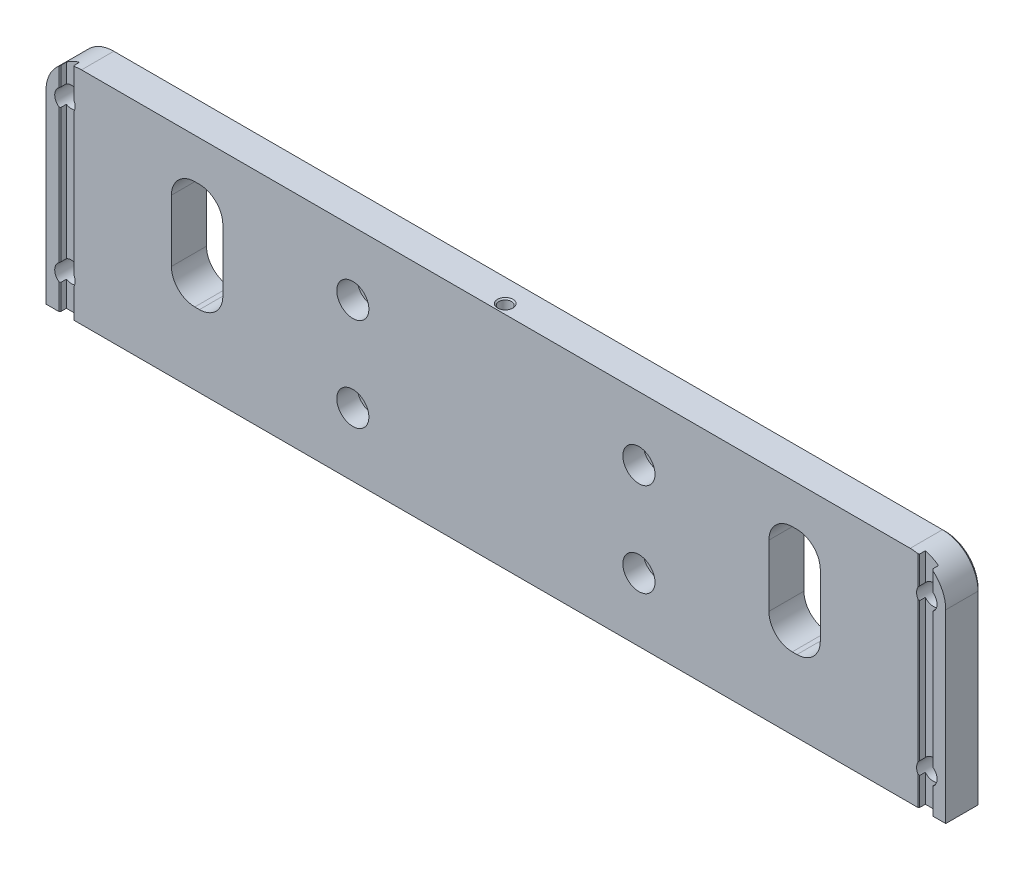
ISO-10303-21;
HEADER;
FILE_DESCRIPTION(('STEP AP214'),'2;1');
FILE_NAME('part.step','',(''),(''),'','','');
FILE_SCHEMA(('AUTOMOTIVE_DESIGN { 1 0 10303 214 1 1 1 1 }'));
ENDSEC;
DATA;
#1=APPLICATION_CONTEXT('core data for automotive mechanical design processes');
#2=APPLICATION_PROTOCOL_DEFINITION('international standard','automotive_design',2000,#1);
#3=PRODUCT_CONTEXT('',#1,'mechanical');
#4=PRODUCT('Part','Part','',(#3));
#5=PRODUCT_RELATED_PRODUCT_CATEGORY('part','',(#4));
#6=PRODUCT_DEFINITION_FORMATION('','',#4);
#7=PRODUCT_DEFINITION_CONTEXT('part definition',#1,'design');
#8=PRODUCT_DEFINITION('design','',#6,#7);
#9=PRODUCT_DEFINITION_SHAPE('','',#8);
#10=(LENGTH_UNIT() NAMED_UNIT(*) SI_UNIT(.MILLI.,.METRE.));
#11=(NAMED_UNIT(*) PLANE_ANGLE_UNIT() SI_UNIT($,.RADIAN.));
#12=(NAMED_UNIT(*) SI_UNIT($,.STERADIAN.) SOLID_ANGLE_UNIT());
#13=UNCERTAINTY_MEASURE_WITH_UNIT(LENGTH_MEASURE(1.E-05),#10,'distance_accuracy_value','');
#14=(GEOMETRIC_REPRESENTATION_CONTEXT(3) GLOBAL_UNCERTAINTY_ASSIGNED_CONTEXT((#13)) GLOBAL_UNIT_ASSIGNED_CONTEXT((#10,
#11,#12)) REPRESENTATION_CONTEXT('',''));
#15=CARTESIAN_POINT('',(0.,0.,0.));
#16=DIRECTION('',(0.,0.,1.));
#17=DIRECTION('',(1.,0.,0.));
#18=AXIS2_PLACEMENT_3D('',#15,#16,#17);
#19=CARTESIAN_POINT('',(118.4529,60.198,-16.256));
#20=DIRECTION('',(0.,-1.,0.));
#21=DIRECTION('',(1.,0.,0.));
#22=AXIS2_PLACEMENT_3D('',#19,#20,#21);
#23=PLANE('',#22);
#24=DIRECTION('',(0.,0.,1.));
#25=VECTOR('',#24,1.);
#26=CARTESIAN_POINT('',(112.5601,60.198,-25.781));
#27=LINE('',#26,#25);
#28=CARTESIAN_POINT('',(112.5601,60.198,-16.256));
#29=VERTEX_POINT('',#28);
#30=CARTESIAN_POINT('',(112.5601,60.198,-25.019));
#31=VERTEX_POINT('',#30);
#32=EDGE_CURVE('E818',#29,#31,#27,.F.);
#33=ORIENTED_EDGE('',*,*,#32,.T.);
#34=DIRECTION('',(-1.,0.,0.));
#35=VECTOR('',#34,1.);
#36=CARTESIAN_POINT('',(-112.5601,60.198,-25.019));
#37=LINE('',#36,#35);
#38=CARTESIAN_POINT('',(-112.5601,60.198,-25.019));
#39=VERTEX_POINT('',#38);
#40=EDGE_CURVE('E869',#31,#39,#37,.T.);
#41=ORIENTED_EDGE('',*,*,#40,.T.);
#42=DIRECTION('',(0.,0.,1.));
#43=VECTOR('',#42,1.);
#44=CARTESIAN_POINT('',(-112.5601,60.198,-16.256));
#45=LINE('',#44,#43);
#46=CARTESIAN_POINT('',(-112.5601,60.198,-16.256));
#47=VERTEX_POINT('',#46);
#48=EDGE_CURVE('E821',#39,#47,#45,.T.);
#49=ORIENTED_EDGE('',*,*,#48,.T.);
#50=DIRECTION('',(-1.,0.,0.));
#51=VECTOR('',#50,1.);
#52=CARTESIAN_POINT('',(113.4618,60.198,-16.256));
#53=LINE('',#52,#51);
#54=EDGE_CURVE('E637',#29,#47,#53,.T.);
#55=ORIENTED_EDGE('',*,*,#54,.F.);
#56=EDGE_LOOP('',(#33,#41,#49,#55));
#57=FACE_BOUND('',#56,.T.);
#58=DIRECTION('',(0.999999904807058,0.,0.000436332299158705));
#59=VECTOR('',#58,1.);
#60=CARTESIAN_POINT('',(2.08279980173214,60.198,-18.7950912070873));
#61=LINE('',#60,#59);
#62=CARTESIAN_POINT('',(2.08305380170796,60.198,-18.7950910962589));
#63=VERTEX_POINT('',#62);
#64=CARTESIAN_POINT('',(2.08279980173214,60.198,-18.7950912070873));
#65=VERTEX_POINT('',#64);
#66=EDGE_CURVE('E480',#63,#65,#61,.F.);
#67=ORIENTED_EDGE('',*,*,#66,.F.);
#68=CARTESIAN_POINT('',(0.,60.198,-18.796));
#69=DIRECTION('',(0.,1.,0.));
#70=DIRECTION('',(0.,0.,1.));
#71=AXIS2_PLACEMENT_3D('',#68,#69,#70);
#72=CIRCLE('',#71,2.083054);
#73=CARTESIAN_POINT('',(2.083054,60.198,-18.796));
#74=VERTEX_POINT('',#73);
#75=EDGE_CURVE('E1013',#74,#63,#72,.T.);
#76=ORIENTED_EDGE('',*,*,#75,.F.);
#77=DIRECTION('',(1.,0.,0.));
#78=VECTOR('',#77,1.);
#79=CARTESIAN_POINT('',(2.0828,60.198,-18.796));
#80=LINE('',#79,#78);
#81=CARTESIAN_POINT('',(2.0828,60.198,-18.796));
#82=VERTEX_POINT('',#81);
#83=EDGE_CURVE('E20',#74,#82,#80,.F.);
#84=ORIENTED_EDGE('',*,*,#83,.T.);
#85=CARTESIAN_POINT('',(0.,60.198,-18.796));
#86=DIRECTION('',(0.,-1.,0.));
#87=DIRECTION('',(1.,0.,0.));
#88=AXIS2_PLACEMENT_3D('',#85,#86,#87);
#89=CIRCLE('',#88,2.0828);
#90=EDGE_CURVE('E26',#82,#65,#89,.T.);
#91=ORIENTED_EDGE('',*,*,#90,.T.);
#92=EDGE_LOOP('',(#67,#76,#84,#91));
#93=FACE_BOUND('',#92,.T.);
#94=ADVANCED_FACE('F16',(#57,#93),#23,.F.);
#95=CARTESIAN_POINT('',(113.4618,60.198,-16.256));
#96=DIRECTION('',(0.,0.,1.));
#97=DIRECTION('',(1.,0.,0.));
#98=AXIS2_PLACEMENT_3D('',#95,#96,#97);
#99=PLANE('',#98);
#100=DIRECTION('',(0.,-1.,0.));
#101=VECTOR('',#100,1.);
#102=CARTESIAN_POINT('',(-88.138,49.276,-16.256));
#103=LINE('',#102,#101);
#104=CARTESIAN_POINT('',(-88.138,42.926,-16.256));
#105=VERTEX_POINT('',#104);
#106=CARTESIAN_POINT('',(-88.138,26.162,-16.256));
#107=VERTEX_POINT('',#106);
#108=EDGE_CURVE('E494',#105,#107,#103,.T.);
#109=ORIENTED_EDGE('',*,*,#108,.F.);
#110=CARTESIAN_POINT('',(-81.788,42.926,-16.256));
#111=DIRECTION('',(0.,0.,1.));
#112=DIRECTION('',(1.,0.,0.));
#113=AXIS2_PLACEMENT_3D('',#110,#111,#112);
#114=CIRCLE('',#113,6.35);
#115=CARTESIAN_POINT('',(-81.788,49.276,-16.256));
#116=VERTEX_POINT('',#115);
#117=EDGE_CURVE('E802',#105,#116,#114,.F.);
#118=ORIENTED_EDGE('',*,*,#117,.T.);
#119=DIRECTION('',(-1.,0.,0.));
#120=VECTOR('',#119,1.);
#121=CARTESIAN_POINT('',(-74.168,49.276,-16.256));
#122=LINE('',#121,#120);
#123=CARTESIAN_POINT('',(-80.518,49.276,-16.256));
#124=VERTEX_POINT('',#123);
#125=EDGE_CURVE('E503',#124,#116,#122,.T.);
#126=ORIENTED_EDGE('',*,*,#125,.F.);
#127=CARTESIAN_POINT('',(-80.518,42.926,-16.256));
#128=DIRECTION('',(0.,0.,1.));
#129=DIRECTION('',(1.,0.,0.));
#130=AXIS2_PLACEMENT_3D('',#127,#128,#129);
#131=CIRCLE('',#130,6.35);
#132=CARTESIAN_POINT('',(-74.168,42.926,-16.256));
#133=VERTEX_POINT('',#132);
#134=EDGE_CURVE('E806',#124,#133,#131,.F.);
#135=ORIENTED_EDGE('',*,*,#134,.T.);
#136=DIRECTION('',(0.,1.,0.));
#137=VECTOR('',#136,1.);
#138=CARTESIAN_POINT('',(-74.168,19.812,-16.256));
#139=LINE('',#138,#137);
#140=CARTESIAN_POINT('',(-74.168,26.162,-16.256));
#141=VERTEX_POINT('',#140);
#142=EDGE_CURVE('E500',#141,#133,#139,.T.);
#143=ORIENTED_EDGE('',*,*,#142,.F.);
#144=CARTESIAN_POINT('',(-80.518,26.162,-16.256));
#145=DIRECTION('',(0.,0.,1.));
#146=DIRECTION('',(1.,0.,0.));
#147=AXIS2_PLACEMENT_3D('',#144,#145,#146);
#148=CIRCLE('',#147,6.35);
#149=CARTESIAN_POINT('',(-80.518,19.812,-16.256));
#150=VERTEX_POINT('',#149);
#151=EDGE_CURVE('E810',#141,#150,#148,.F.);
#152=ORIENTED_EDGE('',*,*,#151,.T.);
#153=DIRECTION('',(1.,0.,0.));
#154=VECTOR('',#153,1.);
#155=CARTESIAN_POINT('',(-88.138,19.812,-16.256));
#156=LINE('',#155,#154);
#157=CARTESIAN_POINT('',(-81.788,19.812,-16.256));
#158=VERTEX_POINT('',#157);
#159=EDGE_CURVE('E497',#158,#150,#156,.T.);
#160=ORIENTED_EDGE('',*,*,#159,.F.);
#161=CARTESIAN_POINT('',(-81.788,26.162,-16.256));
#162=DIRECTION('',(0.,0.,1.));
#163=DIRECTION('',(1.,0.,0.));
#164=AXIS2_PLACEMENT_3D('',#161,#162,#163);
#165=CIRCLE('',#164,6.35);
#166=EDGE_CURVE('E814',#158,#107,#165,.F.);
#167=ORIENTED_EDGE('',*,*,#166,.T.);
#168=EDGE_LOOP('',(#109,#118,#126,#135,#143,#152,#160,#167));
#169=FACE_BOUND('',#168,.T.);
#170=CARTESIAN_POINT('',(-117.0686,9.525,-16.256));
#171=DIRECTION('',(0.,0.,1.));
#172=DIRECTION('',(1.,0.,0.));
#173=AXIS2_PLACEMENT_3D('',#170,#171,#172);
#174=CIRCLE('',#173,2.778125);
#175=CARTESIAN_POINT('',(-114.6429,8.170762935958,-16.256));
#176=VERTEX_POINT('',#175);
#177=CARTESIAN_POINT('',(-114.6429,10.879237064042,-16.256));
#178=VERTEX_POINT('',#177);
#179=EDGE_CURVE('E630',#176,#178,#174,.T.);
#180=ORIENTED_EDGE('',*,*,#179,.F.);
#181=DIRECTION('',(0.,-1.,0.));
#182=VECTOR('',#181,1.);
#183=CARTESIAN_POINT('',(-114.6429,60.198,-16.256));
#184=LINE('',#183,#182);
#185=CARTESIAN_POINT('',(-114.6429,0.254,-16.256));
#186=VERTEX_POINT('',#185);
#187=EDGE_CURVE('E889',#176,#186,#184,.T.);
#188=ORIENTED_EDGE('',*,*,#187,.T.);
#189=DIRECTION('',(-1.,0.,0.));
#190=VECTOR('',#189,1.);
#191=CARTESIAN_POINT('',(113.4618,0.254,-16.256));
#192=LINE('',#191,#190);
#193=CARTESIAN_POINT('',(114.6429,0.254,-16.256));
#194=VERTEX_POINT('',#193);
#195=EDGE_CURVE('E571',#194,#186,#192,.T.);
#196=ORIENTED_EDGE('',*,*,#195,.F.);
#197=DIRECTION('',(0.,1.,0.));
#198=VECTOR('',#197,1.);
#199=CARTESIAN_POINT('',(114.6429,7.79245919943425,-16.256));
#200=LINE('',#199,#198);
#201=CARTESIAN_POINT('',(114.6429,8.17076293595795,-16.256));
#202=VERTEX_POINT('',#201);
#203=EDGE_CURVE('E881',#194,#202,#200,.T.);
#204=ORIENTED_EDGE('',*,*,#203,.T.);
#205=CARTESIAN_POINT('',(117.0686,9.525,-16.256));
#206=DIRECTION('',(0.,0.,1.));
#207=DIRECTION('',(1.,0.,0.));
#208=AXIS2_PLACEMENT_3D('',#205,#206,#207);
#209=CIRCLE('',#208,2.778125);
#210=CARTESIAN_POINT('',(114.6429,10.879237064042,-16.256));
#211=VERTEX_POINT('',#210);
#212=EDGE_CURVE('E626',#211,#202,#209,.T.);
#213=ORIENTED_EDGE('',*,*,#212,.F.);
#214=DIRECTION('',(0.,1.,0.));
#215=VECTOR('',#214,1.);
#216=CARTESIAN_POINT('',(114.6429,48.9404591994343,-16.256));
#217=LINE('',#216,#215);
#218=CARTESIAN_POINT('',(114.6429,49.318762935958,-16.256));
#219=VERTEX_POINT('',#218);
#220=EDGE_CURVE('E879',#211,#219,#217,.T.);
#221=ORIENTED_EDGE('',*,*,#220,.T.);
#222=CARTESIAN_POINT('',(117.0686,50.673,-16.256));
#223=DIRECTION('',(0.,0.,1.));
#224=DIRECTION('',(1.,0.,0.));
#225=AXIS2_PLACEMENT_3D('',#222,#223,#224);
#226=CIRCLE('',#225,2.778125);
#227=CARTESIAN_POINT('',(114.6429,52.027237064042,-16.256));
#228=VERTEX_POINT('',#227);
#229=EDGE_CURVE('E629',#228,#219,#226,.T.);
#230=ORIENTED_EDGE('',*,*,#229,.F.);
#231=DIRECTION('',(0.,1.,0.));
#232=VECTOR('',#231,1.);
#233=CARTESIAN_POINT('',(114.6429,59.9108528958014,-16.256));
#234=LINE('',#233,#232);
#235=CARTESIAN_POINT('',(114.6429,59.9705980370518,-16.256));
#236=VERTEX_POINT('',#235);
#237=EDGE_CURVE('E877',#228,#236,#234,.T.);
#238=ORIENTED_EDGE('',*,*,#237,.T.);
#239=CARTESIAN_POINT('',(112.5601,50.546,-16.256));
#240=DIRECTION('',(0.,0.,1.));
#241=DIRECTION('',(1.,0.,0.));
#242=AXIS2_PLACEMENT_3D('',#239,#240,#241);
#243=CIRCLE('',#242,9.652);
#244=EDGE_CURVE('E823',#236,#29,#243,.T.);
#245=ORIENTED_EDGE('',*,*,#244,.T.);
#246=ORIENTED_EDGE('',*,*,#54,.T.);
#247=CARTESIAN_POINT('',(-112.5601,50.546,-16.256));
#248=DIRECTION('',(0.,0.,1.));
#249=DIRECTION('',(1.,0.,0.));
#250=AXIS2_PLACEMENT_3D('',#247,#248,#249);
#251=CIRCLE('',#250,9.652);
#252=CARTESIAN_POINT('',(-114.6429,59.9705980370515,-16.256));
#253=VERTEX_POINT('',#252);
#254=EDGE_CURVE('E825',#47,#253,#251,.T.);
#255=ORIENTED_EDGE('',*,*,#254,.T.);
#256=DIRECTION('',(0.,-1.,0.));
#257=VECTOR('',#256,1.);
#258=CARTESIAN_POINT('',(-114.6429,60.198,-16.256));
#259=LINE('',#258,#257);
#260=CARTESIAN_POINT('',(-114.6429,52.027237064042,-16.256));
#261=VERTEX_POINT('',#260);
#262=EDGE_CURVE('E883',#253,#261,#259,.T.);
#263=ORIENTED_EDGE('',*,*,#262,.T.);
#264=CARTESIAN_POINT('',(-117.0686,50.673,-16.256));
#265=DIRECTION('',(0.,0.,1.));
#266=DIRECTION('',(1.,0.,0.));
#267=AXIS2_PLACEMENT_3D('',#264,#265,#266);
#268=CIRCLE('',#267,2.778125);
#269=CARTESIAN_POINT('',(-114.6429,49.318762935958,-16.256));
#270=VERTEX_POINT('',#269);
#271=EDGE_CURVE('E672',#270,#261,#268,.T.);
#272=ORIENTED_EDGE('',*,*,#271,.F.);
#273=DIRECTION('',(0.,-1.,0.));
#274=VECTOR('',#273,1.);
#275=CARTESIAN_POINT('',(-114.6429,60.198,-16.256));
#276=LINE('',#275,#274);
#277=EDGE_CURVE('E886',#270,#178,#276,.T.);
#278=ORIENTED_EDGE('',*,*,#277,.T.);
#279=EDGE_LOOP('',(#180,#188,#196,#204,#213,#221,#230,#238,#245,#246,#255,#263,#272,#278));
#280=FACE_BOUND('',#279,.T.);
#281=CARTESIAN_POINT('',(-38.862,42.926,-16.256));
#282=DIRECTION('',(0.,0.,-1.));
#283=DIRECTION('',(-1.,0.,0.));
#284=AXIS2_PLACEMENT_3D('',#281,#282,#283);
#285=CIRCLE('',#284,4.365625);
#286=CARTESIAN_POINT('',(-43.227625,42.926,-16.256));
#287=VERTEX_POINT('',#286);
#288=EDGE_CURVE('E543',#287,#287,#285,.T.);
#289=ORIENTED_EDGE('',*,*,#288,.T.);
#290=EDGE_LOOP('',(#289));
#291=FACE_BOUND('',#290,.T.);
#292=CARTESIAN_POINT('',(-38.862,17.526,-16.256));
#293=DIRECTION('',(0.,0.,-1.));
#294=DIRECTION('',(-1.,0.,0.));
#295=AXIS2_PLACEMENT_3D('',#292,#293,#294);
#296=CIRCLE('',#295,4.365625);
#297=CARTESIAN_POINT('',(-43.227625,17.526,-16.256));
#298=VERTEX_POINT('',#297);
#299=EDGE_CURVE('E536',#298,#298,#296,.T.);
#300=ORIENTED_EDGE('',*,*,#299,.T.);
#301=EDGE_LOOP('',(#300));
#302=FACE_BOUND('',#301,.T.);
#303=CARTESIAN_POINT('',(38.862,42.926,-16.256));
#304=DIRECTION('',(0.,0.,-1.));
#305=DIRECTION('',(-1.,0.,0.));
#306=AXIS2_PLACEMENT_3D('',#303,#304,#305);
#307=CIRCLE('',#306,4.365625);
#308=CARTESIAN_POINT('',(34.496375,42.926,-16.256));
#309=VERTEX_POINT('',#308);
#310=EDGE_CURVE('E529',#309,#309,#307,.T.);
#311=ORIENTED_EDGE('',*,*,#310,.T.);
#312=EDGE_LOOP('',(#311));
#313=FACE_BOUND('',#312,.T.);
#314=CARTESIAN_POINT('',(38.862,17.526,-16.256));
#315=DIRECTION('',(0.,0.,-1.));
#316=DIRECTION('',(-1.,0.,0.));
#317=AXIS2_PLACEMENT_3D('',#314,#315,#316);
#318=CIRCLE('',#317,4.365625);
#319=CARTESIAN_POINT('',(34.496375,17.526,-16.256));
#320=VERTEX_POINT('',#319);
#321=EDGE_CURVE('E518',#320,#320,#318,.T.);
#322=ORIENTED_EDGE('',*,*,#321,.T.);
#323=EDGE_LOOP('',(#322));
#324=FACE_BOUND('',#323,.T.);
#325=DIRECTION('',(0.,1.,0.));
#326=VECTOR('',#325,1.);
#327=CARTESIAN_POINT('',(74.168,19.812,-16.256));
#328=LINE('',#327,#326);
#329=CARTESIAN_POINT('',(74.168,26.162,-16.256));
#330=VERTEX_POINT('',#329);
#331=CARTESIAN_POINT('',(74.168,42.926,-16.256));
#332=VERTEX_POINT('',#331);
#333=EDGE_CURVE('E512',#330,#332,#328,.T.);
#334=ORIENTED_EDGE('',*,*,#333,.T.);
#335=CARTESIAN_POINT('',(80.518,42.926,-16.256));
#336=DIRECTION('',(0.,0.,1.));
#337=DIRECTION('',(1.,0.,0.));
#338=AXIS2_PLACEMENT_3D('',#335,#336,#337);
#339=CIRCLE('',#338,6.35);
#340=CARTESIAN_POINT('',(80.518,49.276,-16.256));
#341=VERTEX_POINT('',#340);
#342=EDGE_CURVE('E798',#332,#341,#339,.F.);
#343=ORIENTED_EDGE('',*,*,#342,.T.);
#344=DIRECTION('',(1.,0.,0.));
#345=VECTOR('',#344,1.);
#346=CARTESIAN_POINT('',(74.168,49.276,-16.256));
#347=LINE('',#346,#345);
#348=CARTESIAN_POINT('',(81.788,49.276,-16.256));
#349=VERTEX_POINT('',#348);
#350=EDGE_CURVE('E515',#341,#349,#347,.T.);
#351=ORIENTED_EDGE('',*,*,#350,.T.);
#352=CARTESIAN_POINT('',(81.788,42.926,-16.256));
#353=DIRECTION('',(0.,0.,1.));
#354=DIRECTION('',(1.,0.,0.));
#355=AXIS2_PLACEMENT_3D('',#352,#353,#354);
#356=CIRCLE('',#355,6.35);
#357=CARTESIAN_POINT('',(88.138,42.926,-16.256));
#358=VERTEX_POINT('',#357);
#359=EDGE_CURVE('E794',#349,#358,#356,.F.);
#360=ORIENTED_EDGE('',*,*,#359,.T.);
#361=DIRECTION('',(0.,-1.,0.));
#362=VECTOR('',#361,1.);
#363=CARTESIAN_POINT('',(88.138,49.276,-16.256));
#364=LINE('',#363,#362);
#365=CARTESIAN_POINT('',(88.138,26.162,-16.256));
#366=VERTEX_POINT('',#365);
#367=EDGE_CURVE('E506',#358,#366,#364,.T.);
#368=ORIENTED_EDGE('',*,*,#367,.T.);
#369=CARTESIAN_POINT('',(81.788,26.162,-16.256));
#370=DIRECTION('',(0.,0.,1.));
#371=DIRECTION('',(1.,0.,0.));
#372=AXIS2_PLACEMENT_3D('',#369,#370,#371);
#373=CIRCLE('',#372,6.35);
#374=CARTESIAN_POINT('',(81.788,19.812,-16.256));
#375=VERTEX_POINT('',#374);
#376=EDGE_CURVE('E790',#366,#375,#373,.F.);
#377=ORIENTED_EDGE('',*,*,#376,.T.);
#378=DIRECTION('',(-1.,0.,0.));
#379=VECTOR('',#378,1.);
#380=CARTESIAN_POINT('',(88.138,19.812,-16.256));
#381=LINE('',#380,#379);
#382=CARTESIAN_POINT('',(80.518,19.812,-16.256));
#383=VERTEX_POINT('',#382);
#384=EDGE_CURVE('E509',#375,#383,#381,.T.);
#385=ORIENTED_EDGE('',*,*,#384,.T.);
#386=CARTESIAN_POINT('',(80.518,26.162,-16.256));
#387=DIRECTION('',(0.,0.,1.));
#388=DIRECTION('',(1.,0.,0.));
#389=AXIS2_PLACEMENT_3D('',#386,#387,#388);
#390=CIRCLE('',#389,6.35);
#391=EDGE_CURVE('E786',#383,#330,#390,.F.);
#392=ORIENTED_EDGE('',*,*,#391,.T.);
#393=EDGE_LOOP('',(#334,#343,#351,#360,#368,#377,#385,#392));
#394=FACE_BOUND('',#393,.T.);
#395=ADVANCED_FACE('F1049',(#169,#280,#291,#302,#313,#324,#394),#99,.T.);
#396=CARTESIAN_POINT('',(-122.2121,60.198,-25.781));
#397=DIRECTION('',(0.,0.,-1.));
#398=DIRECTION('',(-1.,0.,0.));
#399=AXIS2_PLACEMENT_3D('',#396,#397,#398);
#400=PLANE('',#399);
#401=CARTESIAN_POINT('',(112.5601,50.546,-25.781));
#402=DIRECTION('',(0.,0.,-1.));
#403=DIRECTION('',(-1.,0.,0.));
#404=AXIS2_PLACEMENT_3D('',#401,#402,#403);
#405=CIRCLE('',#404,8.89);
#406=CARTESIAN_POINT('',(112.5601,59.436,-25.781));
#407=VERTEX_POINT('',#406);
#408=CARTESIAN_POINT('',(121.4501,50.546,-25.781));
#409=VERTEX_POINT('',#408);
#410=EDGE_CURVE('E859',#407,#409,#405,.T.);
#411=ORIENTED_EDGE('',*,*,#410,.T.);
#412=DIRECTION('',(0.,-1.,0.));
#413=VECTOR('',#412,1.);
#414=CARTESIAN_POINT('',(121.4501,60.198,-25.781));
#415=LINE('',#414,#413);
#416=CARTESIAN_POINT('',(121.4501,1.016,-25.781));
#417=VERTEX_POINT('',#416);
#418=EDGE_CURVE('E861',#409,#417,#415,.T.);
#419=ORIENTED_EDGE('',*,*,#418,.T.);
#420=DIRECTION('',(-1.,0.,0.));
#421=VECTOR('',#420,1.);
#422=CARTESIAN_POINT('',(-122.2121,1.016,-25.781));
#423=LINE('',#422,#421);
#424=CARTESIAN_POINT('',(-121.4501,1.016,-25.781));
#425=VERTEX_POINT('',#424);
#426=EDGE_CURVE('E853',#417,#425,#423,.T.);
#427=ORIENTED_EDGE('',*,*,#426,.T.);
#428=DIRECTION('',(0.,1.,0.));
#429=VECTOR('',#428,1.);
#430=CARTESIAN_POINT('',(-121.4501,50.546,-25.781));
#431=LINE('',#430,#429);
#432=CARTESIAN_POINT('',(-121.4501,50.546,-25.781));
#433=VERTEX_POINT('',#432);
#434=EDGE_CURVE('E851',#425,#433,#431,.T.);
#435=ORIENTED_EDGE('',*,*,#434,.T.);
#436=CARTESIAN_POINT('',(-112.5601,50.546,-25.781));
#437=DIRECTION('',(0.,0.,-1.));
#438=DIRECTION('',(-1.,0.,0.));
#439=AXIS2_PLACEMENT_3D('',#436,#437,#438);
#440=CIRCLE('',#439,8.89);
#441=CARTESIAN_POINT('',(-112.5601,59.436,-25.781));
#442=VERTEX_POINT('',#441);
#443=EDGE_CURVE('E855',#433,#442,#440,.T.);
#444=ORIENTED_EDGE('',*,*,#443,.T.);
#445=DIRECTION('',(1.,0.,0.));
#446=VECTOR('',#445,1.);
#447=CARTESIAN_POINT('',(112.5601,59.436,-25.781));
#448=LINE('',#447,#446);
#449=EDGE_CURVE('E857',#442,#407,#448,.T.);
#450=ORIENTED_EDGE('',*,*,#449,.T.);
#451=EDGE_LOOP('',(#411,#419,#427,#435,#444,#450));
#452=FACE_BOUND('',#451,.T.);
#453=DIRECTION('',(0.,1.,0.));
#454=VECTOR('',#453,1.);
#455=CARTESIAN_POINT('',(-88.138,60.198,-25.781));
#456=LINE('',#455,#454);
#457=CARTESIAN_POINT('',(-88.138,26.162,-25.781));
#458=VERTEX_POINT('',#457);
#459=CARTESIAN_POINT('',(-88.138,42.926,-25.781));
#460=VERTEX_POINT('',#459);
#461=EDGE_CURVE('E743',#458,#460,#456,.T.);
#462=ORIENTED_EDGE('',*,*,#461,.F.);
#463=CARTESIAN_POINT('',(-81.788,26.162,-25.781));
#464=DIRECTION('',(0.,0.,-1.));
#465=DIRECTION('',(-1.,0.,0.));
#466=AXIS2_PLACEMENT_3D('',#463,#464,#465);
#467=CIRCLE('',#466,6.35);
#468=CARTESIAN_POINT('',(-81.788,19.812,-25.781));
#469=VERTEX_POINT('',#468);
#470=EDGE_CURVE('E816',#458,#469,#467,.F.);
#471=ORIENTED_EDGE('',*,*,#470,.T.);
#472=DIRECTION('',(-1.,0.,0.));
#473=VECTOR('',#472,1.);
#474=CARTESIAN_POINT('',(-122.2121,19.812,-25.781));
#475=LINE('',#474,#473);
#476=CARTESIAN_POINT('',(-80.518,19.812,-25.781));
#477=VERTEX_POINT('',#476);
#478=EDGE_CURVE('E740',#477,#469,#475,.T.);
#479=ORIENTED_EDGE('',*,*,#478,.F.);
#480=CARTESIAN_POINT('',(-80.518,26.162,-25.781));
#481=DIRECTION('',(0.,0.,-1.));
#482=DIRECTION('',(-1.,0.,0.));
#483=AXIS2_PLACEMENT_3D('',#480,#481,#482);
#484=CIRCLE('',#483,6.35);
#485=CARTESIAN_POINT('',(-74.168,26.162,-25.781));
#486=VERTEX_POINT('',#485);
#487=EDGE_CURVE('E812',#477,#486,#484,.F.);
#488=ORIENTED_EDGE('',*,*,#487,.T.);
#489=DIRECTION('',(0.,-1.,0.));
#490=VECTOR('',#489,1.);
#491=CARTESIAN_POINT('',(-74.168,60.198,-25.781));
#492=LINE('',#491,#490);
#493=CARTESIAN_POINT('',(-74.168,42.926,-25.781));
#494=VERTEX_POINT('',#493);
#495=EDGE_CURVE('E737',#494,#486,#492,.T.);
#496=ORIENTED_EDGE('',*,*,#495,.F.);
#497=CARTESIAN_POINT('',(-80.518,42.926,-25.781));
#498=DIRECTION('',(0.,0.,-1.));
#499=DIRECTION('',(-1.,0.,0.));
#500=AXIS2_PLACEMENT_3D('',#497,#498,#499);
#501=CIRCLE('',#500,6.35);
#502=CARTESIAN_POINT('',(-80.518,49.276,-25.781));
#503=VERTEX_POINT('',#502);
#504=EDGE_CURVE('E808',#494,#503,#501,.F.);
#505=ORIENTED_EDGE('',*,*,#504,.T.);
#506=DIRECTION('',(1.,0.,0.));
#507=VECTOR('',#506,1.);
#508=CARTESIAN_POINT('',(-122.2121,49.276,-25.781));
#509=LINE('',#508,#507);
#510=CARTESIAN_POINT('',(-81.788,49.276,-25.781));
#511=VERTEX_POINT('',#510);
#512=EDGE_CURVE('E734',#511,#503,#509,.T.);
#513=ORIENTED_EDGE('',*,*,#512,.F.);
#514=CARTESIAN_POINT('',(-81.788,42.926,-25.781));
#515=DIRECTION('',(0.,0.,-1.));
#516=DIRECTION('',(-1.,0.,0.));
#517=AXIS2_PLACEMENT_3D('',#514,#515,#516);
#518=CIRCLE('',#517,6.35);
#519=EDGE_CURVE('E804',#511,#460,#518,.F.);
#520=ORIENTED_EDGE('',*,*,#519,.T.);
#521=EDGE_LOOP('',(#462,#471,#479,#488,#496,#505,#513,#520));
#522=FACE_BOUND('',#521,.T.);
#523=DIRECTION('',(0.,-1.,0.));
#524=VECTOR('',#523,1.);
#525=CARTESIAN_POINT('',(88.138,60.198,-25.781));
#526=LINE('',#525,#524);
#527=CARTESIAN_POINT('',(88.138,42.926,-25.781));
#528=VERTEX_POINT('',#527);
#529=CARTESIAN_POINT('',(88.138,26.162,-25.781));
#530=VERTEX_POINT('',#529);
#531=EDGE_CURVE('E731',#528,#530,#526,.T.);
#532=ORIENTED_EDGE('',*,*,#531,.F.);
#533=CARTESIAN_POINT('',(81.788,42.926,-25.781));
#534=DIRECTION('',(0.,0.,-1.));
#535=DIRECTION('',(-1.,0.,0.));
#536=AXIS2_PLACEMENT_3D('',#533,#534,#535);
#537=CIRCLE('',#536,6.35);
#538=CARTESIAN_POINT('',(81.788,49.276,-25.781));
#539=VERTEX_POINT('',#538);
#540=EDGE_CURVE('E796',#528,#539,#537,.F.);
#541=ORIENTED_EDGE('',*,*,#540,.T.);
#542=DIRECTION('',(1.,0.,0.));
#543=VECTOR('',#542,1.);
#544=CARTESIAN_POINT('',(-122.2121,49.276,-25.781));
#545=LINE('',#544,#543);
#546=CARTESIAN_POINT('',(80.518,49.276,-25.781));
#547=VERTEX_POINT('',#546);
#548=EDGE_CURVE('E714',#547,#539,#545,.T.);
#549=ORIENTED_EDGE('',*,*,#548,.F.);
#550=CARTESIAN_POINT('',(80.518,42.926,-25.781));
#551=DIRECTION('',(0.,0.,-1.));
#552=DIRECTION('',(-1.,0.,0.));
#553=AXIS2_PLACEMENT_3D('',#550,#551,#552);
#554=CIRCLE('',#553,6.35);
#555=CARTESIAN_POINT('',(74.168,42.926,-25.781));
#556=VERTEX_POINT('',#555);
#557=EDGE_CURVE('E800',#547,#556,#554,.F.);
#558=ORIENTED_EDGE('',*,*,#557,.T.);
#559=DIRECTION('',(0.,1.,0.));
#560=VECTOR('',#559,1.);
#561=CARTESIAN_POINT('',(74.168,60.198,-25.781));
#562=LINE('',#561,#560);
#563=CARTESIAN_POINT('',(74.168,26.162,-25.781));
#564=VERTEX_POINT('',#563);
#565=EDGE_CURVE('E725',#564,#556,#562,.T.);
#566=ORIENTED_EDGE('',*,*,#565,.F.);
#567=CARTESIAN_POINT('',(80.518,26.162,-25.781));
#568=DIRECTION('',(0.,0.,-1.));
#569=DIRECTION('',(-1.,0.,0.));
#570=AXIS2_PLACEMENT_3D('',#567,#568,#569);
#571=CIRCLE('',#570,6.35);
#572=CARTESIAN_POINT('',(80.518,19.812,-25.781));
#573=VERTEX_POINT('',#572);
#574=EDGE_CURVE('E788',#564,#573,#571,.F.);
#575=ORIENTED_EDGE('',*,*,#574,.T.);
#576=DIRECTION('',(-1.,0.,0.));
#577=VECTOR('',#576,1.);
#578=CARTESIAN_POINT('',(-122.2121,19.812,-25.781));
#579=LINE('',#578,#577);
#580=CARTESIAN_POINT('',(81.788,19.812,-25.781));
#581=VERTEX_POINT('',#580);
#582=EDGE_CURVE('E728',#581,#573,#579,.T.);
#583=ORIENTED_EDGE('',*,*,#582,.F.);
#584=CARTESIAN_POINT('',(81.788,26.162,-25.781));
#585=DIRECTION('',(0.,0.,-1.));
#586=DIRECTION('',(-1.,0.,0.));
#587=AXIS2_PLACEMENT_3D('',#584,#585,#586);
#588=CIRCLE('',#587,6.35);
#589=EDGE_CURVE('E792',#581,#530,#588,.F.);
#590=ORIENTED_EDGE('',*,*,#589,.T.);
#591=EDGE_LOOP('',(#532,#541,#549,#558,#566,#575,#583,#590));
#592=FACE_BOUND('',#591,.T.);
#593=CARTESIAN_POINT('',(-38.862,42.926,-25.781));
#594=DIRECTION('',(0.,0.,-1.));
#595=DIRECTION('',(-1.,0.,0.));
#596=AXIS2_PLACEMENT_3D('',#593,#594,#595);
#597=CIRCLE('',#596,2.778125);
#598=CARTESIAN_POINT('',(-41.640125,42.926,-25.781));
#599=VERTEX_POINT('',#598);
#600=EDGE_CURVE('E546',#599,#599,#597,.T.);
#601=ORIENTED_EDGE('',*,*,#600,.F.);
#602=EDGE_LOOP('',(#601));
#603=FACE_BOUND('',#602,.T.);
#604=CARTESIAN_POINT('',(-38.862,17.526,-25.781));
#605=DIRECTION('',(0.,0.,-1.));
#606=DIRECTION('',(-1.,0.,0.));
#607=AXIS2_PLACEMENT_3D('',#604,#605,#606);
#608=CIRCLE('',#607,2.778125);
#609=CARTESIAN_POINT('',(-41.640125,17.526,-25.781));
#610=VERTEX_POINT('',#609);
#611=EDGE_CURVE('E549',#610,#610,#608,.T.);
#612=ORIENTED_EDGE('',*,*,#611,.F.);
#613=EDGE_LOOP('',(#612));
#614=FACE_BOUND('',#613,.T.);
#615=CARTESIAN_POINT('',(38.862,17.526,-25.781));
#616=DIRECTION('',(0.,0.,-1.));
#617=DIRECTION('',(-1.,0.,0.));
#618=AXIS2_PLACEMENT_3D('',#615,#616,#617);
#619=CIRCLE('',#618,2.778125);
#620=CARTESIAN_POINT('',(36.083875,17.526,-25.781));
#621=VERTEX_POINT('',#620);
#622=EDGE_CURVE('E552',#621,#621,#619,.T.);
#623=ORIENTED_EDGE('',*,*,#622,.F.);
#624=EDGE_LOOP('',(#623));
#625=FACE_BOUND('',#624,.T.);
#626=CARTESIAN_POINT('',(38.862,42.926,-25.781));
#627=DIRECTION('',(0.,0.,-1.));
#628=DIRECTION('',(-1.,0.,0.));
#629=AXIS2_PLACEMENT_3D('',#626,#627,#628);
#630=CIRCLE('',#629,2.778125);
#631=CARTESIAN_POINT('',(36.083875,42.926,-25.781));
#632=VERTEX_POINT('',#631);
#633=EDGE_CURVE('E555',#632,#632,#630,.T.);
#634=ORIENTED_EDGE('',*,*,#633,.F.);
#635=EDGE_LOOP('',(#634));
#636=FACE_BOUND('',#635,.T.);
#637=CARTESIAN_POINT('',(-117.0686,50.673,-25.781));
#638=DIRECTION('',(0.,0.,-1.));
#639=DIRECTION('',(-1.,0.,0.));
#640=AXIS2_PLACEMENT_3D('',#637,#638,#639);
#641=CIRCLE('',#640,2.778125);
#642=CARTESIAN_POINT('',(-119.846725,50.673,-25.781));
#643=VERTEX_POINT('',#642);
#644=EDGE_CURVE('E586',#643,#643,#641,.T.);
#645=ORIENTED_EDGE('',*,*,#644,.F.);
#646=EDGE_LOOP('',(#645));
#647=FACE_BOUND('',#646,.T.);
#648=CARTESIAN_POINT('',(117.0686,50.673,-25.781));
#649=DIRECTION('',(0.,0.,-1.));
#650=DIRECTION('',(-1.,0.,0.));
#651=AXIS2_PLACEMENT_3D('',#648,#649,#650);
#652=CIRCLE('',#651,2.778125);
#653=CARTESIAN_POINT('',(114.290475,50.673,-25.781));
#654=VERTEX_POINT('',#653);
#655=EDGE_CURVE('E660',#654,#654,#652,.T.);
#656=ORIENTED_EDGE('',*,*,#655,.F.);
#657=EDGE_LOOP('',(#656));
#658=FACE_BOUND('',#657,.T.);
#659=CARTESIAN_POINT('',(117.0686,9.525,-25.781));
#660=DIRECTION('',(0.,0.,-1.));
#661=DIRECTION('',(-1.,0.,0.));
#662=AXIS2_PLACEMENT_3D('',#659,#660,#661);
#663=CIRCLE('',#662,2.778125);
#664=CARTESIAN_POINT('',(114.290475,9.525,-25.781));
#665=VERTEX_POINT('',#664);
#666=EDGE_CURVE('E605',#665,#665,#663,.T.);
#667=ORIENTED_EDGE('',*,*,#666,.F.);
#668=EDGE_LOOP('',(#667));
#669=FACE_BOUND('',#668,.T.);
#670=CARTESIAN_POINT('',(-117.0686,9.525,-25.781));
#671=DIRECTION('',(0.,0.,-1.));
#672=DIRECTION('',(-1.,0.,0.));
#673=AXIS2_PLACEMENT_3D('',#670,#671,#672);
#674=CIRCLE('',#673,2.778125);
#675=CARTESIAN_POINT('',(-119.846725,9.525,-25.781));
#676=VERTEX_POINT('',#675);
#677=EDGE_CURVE('E617',#676,#676,#674,.T.);
#678=ORIENTED_EDGE('',*,*,#677,.F.);
#679=EDGE_LOOP('',(#678));
#680=FACE_BOUND('',#679,.T.);
#681=ADVANCED_FACE('F1055',(#452,#522,#592,#603,#614,#625,#636,#647,#658,#669,#680),#400,.T.);
#682=CARTESIAN_POINT('',(118.4529,60.198,-16.256));
#683=DIRECTION('',(0.,0.,-1.));
#684=DIRECTION('',(-1.,0.,0.));
#685=AXIS2_PLACEMENT_3D('',#682,#683,#684);
#686=PLANE('',#685);
#687=CARTESIAN_POINT('',(117.0686,9.525,-16.256));
#688=DIRECTION('',(0.,0.,-1.));
#689=DIRECTION('',(-1.,0.,0.));
#690=AXIS2_PLACEMENT_3D('',#687,#688,#689);
#691=CIRCLE('',#690,2.778125);
#692=CARTESIAN_POINT('',(118.7069,11.7686469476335,-16.256));
#693=VERTEX_POINT('',#692);
#694=CARTESIAN_POINT('',(118.7069,7.28135305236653,-16.256));
#695=VERTEX_POINT('',#694);
#696=EDGE_CURVE('E613',#693,#695,#691,.T.);
#697=ORIENTED_EDGE('',*,*,#696,.T.);
#698=DIRECTION('',(0.,-1.,0.));
#699=VECTOR('',#698,1.);
#700=CARTESIAN_POINT('',(118.7069,60.198,-16.256));
#701=LINE('',#700,#699);
#702=CARTESIAN_POINT('',(118.7069,0.254,-16.256));
#703=VERTEX_POINT('',#702);
#704=EDGE_CURVE('E947',#695,#703,#701,.T.);
#705=ORIENTED_EDGE('',*,*,#704,.T.);
#706=DIRECTION('',(1.,0.,0.));
#707=VECTOR('',#706,1.);
#708=CARTESIAN_POINT('',(118.4529,0.254,-16.256));
#709=LINE('',#708,#707);
#710=CARTESIAN_POINT('',(122.2121,0.254,-16.256));
#711=VERTEX_POINT('',#710);
#712=EDGE_CURVE('E574',#703,#711,#709,.T.);
#713=ORIENTED_EDGE('',*,*,#712,.T.);
#714=DIRECTION('',(0.,-1.,0.));
#715=VECTOR('',#714,1.);
#716=CARTESIAN_POINT('',(122.2121,60.198,-16.256));
#717=LINE('',#716,#715);
#718=CARTESIAN_POINT('',(122.2121,50.546,-16.256));
#719=VERTEX_POINT('',#718);
#720=EDGE_CURVE('E558',#719,#711,#717,.T.);
#721=ORIENTED_EDGE('',*,*,#720,.F.);
#722=CARTESIAN_POINT('',(112.5601,50.546,-16.256));
#723=DIRECTION('',(0.,0.,-1.));
#724=DIRECTION('',(-1.,0.,0.));
#725=AXIS2_PLACEMENT_3D('',#722,#723,#724);
#726=CIRCLE('',#725,9.652);
#727=CARTESIAN_POINT('',(118.7069,57.9876364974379,-16.256));
#728=VERTEX_POINT('',#727);
#729=EDGE_CURVE('E842',#719,#728,#726,.F.);
#730=ORIENTED_EDGE('',*,*,#729,.T.);
#731=DIRECTION('',(0.,-1.,0.));
#732=VECTOR('',#731,1.);
#733=CARTESIAN_POINT('',(118.7069,60.198,-16.256));
#734=LINE('',#733,#732);
#735=CARTESIAN_POINT('',(118.7069,52.9166469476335,-16.256));
#736=VERTEX_POINT('',#735);
#737=EDGE_CURVE('E941',#728,#736,#734,.T.);
#738=ORIENTED_EDGE('',*,*,#737,.T.);
#739=CARTESIAN_POINT('',(117.0686,50.673,-16.256));
#740=DIRECTION('',(0.,0.,-1.));
#741=DIRECTION('',(-1.,0.,0.));
#742=AXIS2_PLACEMENT_3D('',#739,#740,#741);
#743=CIRCLE('',#742,2.778125);
#744=CARTESIAN_POINT('',(118.7069,48.4293530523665,-16.256));
#745=VERTEX_POINT('',#744);
#746=EDGE_CURVE('E609',#736,#745,#743,.T.);
#747=ORIENTED_EDGE('',*,*,#746,.T.);
#748=DIRECTION('',(0.,-1.,0.));
#749=VECTOR('',#748,1.);
#750=CARTESIAN_POINT('',(118.7069,60.198,-16.256));
#751=LINE('',#750,#749);
#752=EDGE_CURVE('E944',#745,#693,#751,.T.);
#753=ORIENTED_EDGE('',*,*,#752,.T.);
#754=EDGE_LOOP('',(#697,#705,#713,#721,#730,#738,#747,#753));
#755=FACE_BOUND('',#754,.T.);
#756=ADVANCED_FACE('F1082',(#755),#686,.F.);
#757=CARTESIAN_POINT('',(0.,0.254,0.));
#758=DIRECTION('',(0.,1.,0.));
#759=DIRECTION('',(0.,0.,1.));
#760=AXIS2_PLACEMENT_3D('',#757,#758,#759);
#761=PLANE('',#760);
#762=ORIENTED_EDGE('',*,*,#195,.T.);
#763=DIRECTION('',(0.707106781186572,0.,0.707106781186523));
#764=VECTOR('',#763,1.);
#765=CARTESIAN_POINT('',(-114.6429,0.254,-16.256));
#766=LINE('',#765,#764);
#767=CARTESIAN_POINT('',(-114.8969,0.254,-16.51));
#768=VERTEX_POINT('',#767);
#769=EDGE_CURVE('E898',#186,#768,#766,.F.);
#770=ORIENTED_EDGE('',*,*,#769,.T.);
#771=DIRECTION('',(0.,0.,-1.));
#772=VECTOR('',#771,1.);
#773=CARTESIAN_POINT('',(-114.8969,0.254,-16.256));
#774=LINE('',#773,#772);
#775=CARTESIAN_POINT('',(-114.8969,0.254,-18.034));
#776=VERTEX_POINT('',#775);
#777=EDGE_CURVE('E569',#768,#776,#774,.T.);
#778=ORIENTED_EDGE('',*,*,#777,.T.);
#779=DIRECTION('',(-1.,0.,0.));
#780=VECTOR('',#779,1.);
#781=CARTESIAN_POINT('',(-114.8969,0.254,-18.034));
#782=LINE('',#781,#780);
#783=CARTESIAN_POINT('',(-118.4529,0.254,-18.034));
#784=VERTEX_POINT('',#783);
#785=EDGE_CURVE('E675',#776,#784,#782,.T.);
#786=ORIENTED_EDGE('',*,*,#785,.T.);
#787=DIRECTION('',(0.,0.,1.));
#788=VECTOR('',#787,1.);
#789=CARTESIAN_POINT('',(-118.4529,0.254,-17.78));
#790=LINE('',#789,#788);
#791=CARTESIAN_POINT('',(-118.4529,0.254,-16.51));
#792=VERTEX_POINT('',#791);
#793=EDGE_CURVE('E564',#784,#792,#790,.T.);
#794=ORIENTED_EDGE('',*,*,#793,.T.);
#795=DIRECTION('',(0.707106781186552,0.,-0.707106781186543));
#796=VECTOR('',#795,1.);
#797=CARTESIAN_POINT('',(-118.4529,0.254,-16.51));
#798=LINE('',#797,#796);
#799=CARTESIAN_POINT('',(-118.7069,0.254,-16.256));
#800=VERTEX_POINT('',#799);
#801=EDGE_CURVE('E896',#792,#800,#798,.F.);
#802=ORIENTED_EDGE('',*,*,#801,.T.);
#803=DIRECTION('',(-1.,0.,0.));
#804=VECTOR('',#803,1.);
#805=CARTESIAN_POINT('',(-118.4529,0.254,-16.256));
#806=LINE('',#805,#804);
#807=CARTESIAN_POINT('',(-122.2121,0.254,-16.256));
#808=VERTEX_POINT('',#807);
#809=EDGE_CURVE('E567',#800,#808,#806,.T.);
#810=ORIENTED_EDGE('',*,*,#809,.T.);
#811=DIRECTION('',(0.,0.,-1.));
#812=VECTOR('',#811,1.);
#813=CARTESIAN_POINT('',(-122.2121,0.254,0.));
#814=LINE('',#813,#812);
#815=CARTESIAN_POINT('',(-122.2121,0.254,-25.019));
#816=VERTEX_POINT('',#815);
#817=EDGE_CURVE('E708',#808,#816,#814,.T.);
#818=ORIENTED_EDGE('',*,*,#817,.T.);
#819=DIRECTION('',(1.,0.,0.));
#820=VECTOR('',#819,1.);
#821=CARTESIAN_POINT('',(122.2121,0.254,-25.019));
#822=LINE('',#821,#820);
#823=CARTESIAN_POINT('',(122.2121,0.254,-25.019));
#824=VERTEX_POINT('',#823);
#825=EDGE_CURVE('E873',#816,#824,#822,.T.);
#826=ORIENTED_EDGE('',*,*,#825,.T.);
#827=DIRECTION('',(0.,0.,-1.));
#828=VECTOR('',#827,1.);
#829=CARTESIAN_POINT('',(122.2121,0.254,0.));
#830=LINE('',#829,#828);
#831=EDGE_CURVE('E711',#711,#824,#830,.T.);
#832=ORIENTED_EDGE('',*,*,#831,.F.);
#833=ORIENTED_EDGE('',*,*,#712,.F.);
#834=DIRECTION('',(0.707106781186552,0.,0.707106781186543));
#835=VECTOR('',#834,1.);
#836=CARTESIAN_POINT('',(118.7069,0.254,-16.256));
#837=LINE('',#836,#835);
#838=CARTESIAN_POINT('',(118.4529,0.254,-16.51));
#839=VERTEX_POINT('',#838);
#840=EDGE_CURVE('E894',#703,#839,#837,.F.);
#841=ORIENTED_EDGE('',*,*,#840,.T.);
#842=DIRECTION('',(0.,0.,1.));
#843=VECTOR('',#842,1.);
#844=CARTESIAN_POINT('',(118.4529,0.254,-17.78));
#845=LINE('',#844,#843);
#846=CARTESIAN_POINT('',(118.4529,0.254,-18.034));
#847=VERTEX_POINT('',#846);
#848=EDGE_CURVE('E576',#847,#839,#845,.T.);
#849=ORIENTED_EDGE('',*,*,#848,.F.);
#850=DIRECTION('',(1.,0.,0.));
#851=VECTOR('',#850,1.);
#852=CARTESIAN_POINT('',(114.8969,0.254,-18.034));
#853=LINE('',#852,#851);
#854=CARTESIAN_POINT('',(114.8969,0.254,-18.034));
#855=VERTEX_POINT('',#854);
#856=EDGE_CURVE('E579',#855,#847,#853,.T.);
#857=ORIENTED_EDGE('',*,*,#856,.F.);
#858=DIRECTION('',(0.,0.,-1.));
#859=VECTOR('',#858,1.);
#860=CARTESIAN_POINT('',(114.8969,0.254,-16.256));
#861=LINE('',#860,#859);
#862=CARTESIAN_POINT('',(114.8969,0.254,-16.51));
#863=VERTEX_POINT('',#862);
#864=EDGE_CURVE('E581',#863,#855,#861,.T.);
#865=ORIENTED_EDGE('',*,*,#864,.F.);
#866=DIRECTION('',(-0.707106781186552,0.,0.707106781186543));
#867=VECTOR('',#866,1.);
#868=CARTESIAN_POINT('',(114.8969,0.254,-16.51));
#869=LINE('',#868,#867);
#870=EDGE_CURVE('E892',#863,#194,#869,.T.);
#871=ORIENTED_EDGE('',*,*,#870,.T.);
#872=EDGE_LOOP('',(#762,#770,#778,#786,#794,#802,#810,#818,#826,#832,#833,#841,#849,#857,#865,#871));
#873=FACE_BOUND('',#872,.T.);
#874=ADVANCED_FACE('F1086',(#873),#761,.F.);
#875=CARTESIAN_POINT('',(-118.4529,60.198,-17.78));
#876=DIRECTION('',(1.,0.,0.));
#877=DIRECTION('',(0.,0.,-1.));
#878=AXIS2_PLACEMENT_3D('',#875,#876,#877);
#879=PLANE('',#878);
#880=DIRECTION('',(0.,0.,1.));
#881=VECTOR('',#880,1.);
#882=CARTESIAN_POINT('',(-118.4529,58.1903451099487,-18.034));
#883=LINE('',#882,#881);
#884=CARTESIAN_POINT('',(-118.4529,58.1903451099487,-18.034));
#885=VERTEX_POINT('',#884);
#886=CARTESIAN_POINT('',(-118.4529,58.1903451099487,-16.51));
#887=VERTEX_POINT('',#886);
#888=EDGE_CURVE('E832',#885,#887,#883,.T.);
#889=ORIENTED_EDGE('',*,*,#888,.T.);
#890=DIRECTION('',(0.,-1.,0.));
#891=VECTOR('',#890,1.);
#892=CARTESIAN_POINT('',(-118.4529,60.198,-16.51));
#893=LINE('',#892,#891);
#894=CARTESIAN_POINT('',(-118.4529,53.0816701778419,-16.51));
#895=VERTEX_POINT('',#894);
#896=EDGE_CURVE('E938',#887,#895,#893,.T.);
#897=ORIENTED_EDGE('',*,*,#896,.T.);
#898=DIRECTION('',(0.,0.,1.));
#899=VECTOR('',#898,1.);
#900=CARTESIAN_POINT('',(-118.4529,53.0816701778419,-17.145));
#901=LINE('',#900,#899);
#902=CARTESIAN_POINT('',(-118.4529,53.0816701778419,-18.034));
#903=VERTEX_POINT('',#902);
#904=EDGE_CURVE('E661',#903,#895,#901,.T.);
#905=ORIENTED_EDGE('',*,*,#904,.F.);
#906=DIRECTION('',(0.,-1.,0.));
#907=VECTOR('',#906,1.);
#908=CARTESIAN_POINT('',(-118.4529,60.198,-18.034));
#909=LINE('',#908,#907);
#910=EDGE_CURVE('E598',#885,#903,#909,.T.);
#911=ORIENTED_EDGE('',*,*,#910,.F.);
#912=EDGE_LOOP('',(#889,#897,#905,#911));
#913=FACE_BOUND('',#912,.T.);
#914=ADVANCED_FACE('F1074',(#913),#879,.T.);
#915=CARTESIAN_POINT('',(-114.8969,60.198,-18.034));
#916=DIRECTION('',(0.,0.,1.));
#917=DIRECTION('',(1.,0.,0.));
#918=AXIS2_PLACEMENT_3D('',#915,#916,#917);
#919=PLANE('',#918);
#920=DIRECTION('',(0.,-1.,0.));
#921=VECTOR('',#920,1.);
#922=CARTESIAN_POINT('',(-114.8969,60.198,-18.034));
#923=LINE('',#922,#921);
#924=CARTESIAN_POINT('',(-114.8969,59.9108528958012,-18.034));
#925=VERTEX_POINT('',#924);
#926=CARTESIAN_POINT('',(-114.8969,52.4055408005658,-18.034));
#927=VERTEX_POINT('',#926);
#928=EDGE_CURVE('E603',#925,#927,#923,.T.);
#929=ORIENTED_EDGE('',*,*,#928,.F.);
#930=CARTESIAN_POINT('',(-112.5601,50.546,-18.034));
#931=DIRECTION('',(0.,0.,1.));
#932=DIRECTION('',(1.,0.,0.));
#933=AXIS2_PLACEMENT_3D('',#930,#931,#932);
#934=CIRCLE('',#933,9.652);
#935=EDGE_CURVE('E830',#925,#885,#934,.T.);
#936=ORIENTED_EDGE('',*,*,#935,.T.);
#937=ORIENTED_EDGE('',*,*,#910,.T.);
#938=CARTESIAN_POINT('',(-117.0686,50.673,-18.034));
#939=DIRECTION('',(0.,0.,1.));
#940=DIRECTION('',(1.,0.,0.));
#941=AXIS2_PLACEMENT_3D('',#938,#939,#940);
#942=CIRCLE('',#941,2.778125);
#943=EDGE_CURVE('E665',#927,#903,#942,.T.);
#944=ORIENTED_EDGE('',*,*,#943,.F.);
#945=EDGE_LOOP('',(#929,#936,#937,#944));
#946=FACE_BOUND('',#945,.T.);
#947=ADVANCED_FACE('F1108',(#946),#919,.T.);
#948=CARTESIAN_POINT('',(-114.8969,60.198,-16.256));
#949=DIRECTION('',(-1.,0.,0.));
#950=DIRECTION('',(0.,0.,1.));
#951=AXIS2_PLACEMENT_3D('',#948,#949,#950);
#952=PLANE('',#951);
#953=DIRECTION('',(0.,0.,1.));
#954=VECTOR('',#953,1.);
#955=CARTESIAN_POINT('',(-114.8969,11.2575408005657,-17.145));
#956=LINE('',#955,#954);
#957=CARTESIAN_POINT('',(-114.8969,11.2575408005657,-16.51));
#958=VERTEX_POINT('',#957);
#959=CARTESIAN_POINT('',(-114.8969,11.2575408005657,-18.034));
#960=VERTEX_POINT('',#959);
#961=EDGE_CURVE('E646',#958,#960,#956,.F.);
#962=ORIENTED_EDGE('',*,*,#961,.F.);
#963=DIRECTION('',(0.,1.,0.));
#964=VECTOR('',#963,1.);
#965=CARTESIAN_POINT('',(-114.8969,60.198,-16.51));
#966=LINE('',#965,#964);
#967=CARTESIAN_POINT('',(-114.8969,48.9404591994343,-16.51));
#968=VERTEX_POINT('',#967);
#969=EDGE_CURVE('E919',#958,#968,#966,.T.);
#970=ORIENTED_EDGE('',*,*,#969,.T.);
#971=DIRECTION('',(0.,0.,1.));
#972=VECTOR('',#971,1.);
#973=CARTESIAN_POINT('',(-114.8969,48.9404591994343,-17.145));
#974=LINE('',#973,#972);
#975=CARTESIAN_POINT('',(-114.8969,48.9404591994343,-18.034));
#976=VERTEX_POINT('',#975);
#977=EDGE_CURVE('E671',#976,#968,#974,.T.);
#978=ORIENTED_EDGE('',*,*,#977,.F.);
#979=EDGE_CURVE('E600',#976,#960,#923,.T.);
#980=ORIENTED_EDGE('',*,*,#979,.T.);
#981=EDGE_LOOP('',(#962,#970,#978,#980));
#982=FACE_BOUND('',#981,.T.);
#983=ADVANCED_FACE('F1067',(#982),#952,.T.);
#984=CARTESIAN_POINT('',(114.8969,60.198,-18.034));
#985=DIRECTION('',(0.,0.,-1.));
#986=DIRECTION('',(-1.,0.,0.));
#987=AXIS2_PLACEMENT_3D('',#984,#985,#986);
#988=PLANE('',#987);
#989=DIRECTION('',(0.,-1.,0.));
#990=VECTOR('',#989,1.);
#991=CARTESIAN_POINT('',(118.4529,60.198,-18.034));
#992=LINE('',#991,#990);
#993=CARTESIAN_POINT('',(118.4529,58.1903451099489,-18.034));
#994=VERTEX_POINT('',#993);
#995=CARTESIAN_POINT('',(118.4529,53.0816701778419,-18.034));
#996=VERTEX_POINT('',#995);
#997=EDGE_CURVE('E594',#994,#996,#992,.T.);
#998=ORIENTED_EDGE('',*,*,#997,.F.);
#999=CARTESIAN_POINT('',(112.5601,50.546,-18.034));
#1000=DIRECTION('',(0.,0.,-1.));
#1001=DIRECTION('',(-1.,0.,0.));
#1002=AXIS2_PLACEMENT_3D('',#999,#1000,#1001);
#1003=CIRCLE('',#1002,9.652);
#1004=CARTESIAN_POINT('',(114.8969,59.9108528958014,-18.034));
#1005=VERTEX_POINT('',#1004);
#1006=EDGE_CURVE('E847',#994,#1005,#1003,.F.);
#1007=ORIENTED_EDGE('',*,*,#1006,.T.);
#1008=DIRECTION('',(0.,-1.,0.));
#1009=VECTOR('',#1008,1.);
#1010=CARTESIAN_POINT('',(114.8969,60.198,-18.034));
#1011=LINE('',#1010,#1009);
#1012=CARTESIAN_POINT('',(114.8969,52.4055408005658,-18.034));
#1013=VERTEX_POINT('',#1012);
#1014=EDGE_CURVE('E590',#1005,#1013,#1011,.T.);
#1015=ORIENTED_EDGE('',*,*,#1014,.T.);
#1016=CARTESIAN_POINT('',(117.0686,50.673,-18.034));
#1017=DIRECTION('',(0.,0.,-1.));
#1018=DIRECTION('',(-1.,0.,0.));
#1019=AXIS2_PLACEMENT_3D('',#1016,#1017,#1018);
#1020=CIRCLE('',#1019,2.778125);
#1021=EDGE_CURVE('E692',#1013,#996,#1020,.T.);
#1022=ORIENTED_EDGE('',*,*,#1021,.T.);
#1023=EDGE_LOOP('',(#998,#1007,#1015,#1022));
#1024=FACE_BOUND('',#1023,.T.);
#1025=ADVANCED_FACE('F1103',(#1024),#988,.F.);
#1026=CARTESIAN_POINT('',(118.4529,60.198,-17.78));
#1027=DIRECTION('',(1.,0.,0.));
#1028=DIRECTION('',(0.,0.,-1.));
#1029=AXIS2_PLACEMENT_3D('',#1026,#1027,#1028);
#1030=PLANE('',#1029);
#1031=DIRECTION('',(0.,0.,1.));
#1032=VECTOR('',#1031,1.);
#1033=CARTESIAN_POINT('',(118.4529,53.0816701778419,-17.145));
#1034=LINE('',#1033,#1032);
#1035=CARTESIAN_POINT('',(118.4529,53.0816701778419,-16.51));
#1036=VERTEX_POINT('',#1035);
#1037=EDGE_CURVE('E685',#996,#1036,#1034,.T.);
#1038=ORIENTED_EDGE('',*,*,#1037,.T.);
#1039=DIRECTION('',(0.,1.,0.));
#1040=VECTOR('',#1039,1.);
#1041=CARTESIAN_POINT('',(118.4529,60.198,-16.51));
#1042=LINE('',#1041,#1040);
#1043=CARTESIAN_POINT('',(118.4529,58.1903451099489,-16.51));
#1044=VERTEX_POINT('',#1043);
#1045=EDGE_CURVE('E976',#1036,#1044,#1042,.T.);
#1046=ORIENTED_EDGE('',*,*,#1045,.T.);
#1047=DIRECTION('',(0.,0.,-1.));
#1048=VECTOR('',#1047,1.);
#1049=CARTESIAN_POINT('',(118.4529,58.1903451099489,-16.256));
#1050=LINE('',#1049,#1048);
#1051=EDGE_CURVE('E845',#1044,#994,#1050,.T.);
#1052=ORIENTED_EDGE('',*,*,#1051,.T.);
#1053=ORIENTED_EDGE('',*,*,#997,.T.);
#1054=EDGE_LOOP('',(#1038,#1046,#1052,#1053));
#1055=FACE_BOUND('',#1054,.T.);
#1056=ADVANCED_FACE('F1092',(#1055),#1030,.F.);
#1057=CARTESIAN_POINT('',(114.8969,60.198,-16.256));
#1058=DIRECTION('',(-1.,0.,0.));
#1059=DIRECTION('',(0.,0.,1.));
#1060=AXIS2_PLACEMENT_3D('',#1057,#1058,#1059);
#1061=PLANE('',#1060);
#1062=DIRECTION('',(0.,0.,1.));
#1063=VECTOR('',#1062,1.);
#1064=CARTESIAN_POINT('',(114.8969,48.9404591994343,-17.145));
#1065=LINE('',#1064,#1063);
#1066=CARTESIAN_POINT('',(114.8969,48.9404591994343,-18.034));
#1067=VERTEX_POINT('',#1066);
#1068=CARTESIAN_POINT('',(114.8969,48.9404591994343,-16.51));
#1069=VERTEX_POINT('',#1068);
#1070=EDGE_CURVE('E696',#1067,#1069,#1065,.T.);
#1071=ORIENTED_EDGE('',*,*,#1070,.T.);
#1072=DIRECTION('',(0.,-1.,0.));
#1073=VECTOR('',#1072,1.);
#1074=CARTESIAN_POINT('',(114.8969,11.2575408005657,-16.51));
#1075=LINE('',#1074,#1073);
#1076=CARTESIAN_POINT('',(114.8969,11.2575408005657,-16.51));
#1077=VERTEX_POINT('',#1076);
#1078=EDGE_CURVE('E973',#1069,#1077,#1075,.T.);
#1079=ORIENTED_EDGE('',*,*,#1078,.T.);
#1080=DIRECTION('',(0.,0.,1.));
#1081=VECTOR('',#1080,1.);
#1082=CARTESIAN_POINT('',(114.8969,11.2575408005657,-17.145));
#1083=LINE('',#1082,#1081);
#1084=CARTESIAN_POINT('',(114.8969,11.2575408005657,-18.034));
#1085=VERTEX_POINT('',#1084);
#1086=EDGE_CURVE('E608',#1077,#1085,#1083,.F.);
#1087=ORIENTED_EDGE('',*,*,#1086,.T.);
#1088=EDGE_CURVE('E587',#1067,#1085,#1011,.T.);
#1089=ORIENTED_EDGE('',*,*,#1088,.F.);
#1090=EDGE_LOOP('',(#1071,#1079,#1087,#1089));
#1091=FACE_BOUND('',#1090,.T.);
#1092=ADVANCED_FACE('F1098',(#1091),#1061,.F.);
#1093=DIRECTION('',(0.,0.,1.));
#1094=VECTOR('',#1093,1.);
#1095=CARTESIAN_POINT('',(114.8969,7.79245919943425,-17.145));
#1096=LINE('',#1095,#1094);
#1097=CARTESIAN_POINT('',(114.8969,7.79245919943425,-18.034));
#1098=VERTEX_POINT('',#1097);
#1099=CARTESIAN_POINT('',(114.8969,7.79245919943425,-16.51));
#1100=VERTEX_POINT('',#1099);
#1101=EDGE_CURVE('E623',#1098,#1100,#1096,.T.);
#1102=ORIENTED_EDGE('',*,*,#1101,.T.);
#1103=DIRECTION('',(0.,-1.,0.));
#1104=VECTOR('',#1103,1.);
#1105=CARTESIAN_POINT('',(114.8969,0.254000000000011,-16.51));
#1106=LINE('',#1105,#1104);
#1107=EDGE_CURVE('E960',#1100,#863,#1106,.T.);
#1108=ORIENTED_EDGE('',*,*,#1107,.T.);
#1109=ORIENTED_EDGE('',*,*,#864,.T.);
#1110=EDGE_CURVE('E591',#1098,#855,#1011,.T.);
#1111=ORIENTED_EDGE('',*,*,#1110,.F.);
#1112=EDGE_LOOP('',(#1102,#1108,#1109,#1111));
#1113=FACE_BOUND('',#1112,.T.);
#1114=ADVANCED_FACE('F1099',(#1113),#1061,.F.);
#1115=CARTESIAN_POINT('',(118.4529,48.2643298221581,-18.034));
#1116=VERTEX_POINT('',#1115);
#1117=CARTESIAN_POINT('',(118.4529,11.9336701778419,-18.034));
#1118=VERTEX_POINT('',#1117);
#1119=EDGE_CURVE('E592',#1116,#1118,#992,.T.);
#1120=ORIENTED_EDGE('',*,*,#1119,.F.);
#1121=CARTESIAN_POINT('',(117.0686,50.673,-18.034));
#1122=DIRECTION('',(0.,0.,-1.));
#1123=DIRECTION('',(-1.,0.,0.));
#1124=AXIS2_PLACEMENT_3D('',#1121,#1122,#1123);
#1125=CIRCLE('',#1124,2.778125);
#1126=EDGE_CURVE('E693',#1116,#1067,#1125,.T.);
#1127=ORIENTED_EDGE('',*,*,#1126,.T.);
#1128=ORIENTED_EDGE('',*,*,#1088,.T.);
#1129=CARTESIAN_POINT('',(117.0686,9.525,-18.034));
#1130=DIRECTION('',(0.,0.,-1.));
#1131=DIRECTION('',(-1.,0.,0.));
#1132=AXIS2_PLACEMENT_3D('',#1129,#1130,#1131);
#1133=CIRCLE('',#1132,2.778125);
#1134=EDGE_CURVE('E619',#1085,#1118,#1133,.T.);
#1135=ORIENTED_EDGE('',*,*,#1134,.T.);
#1136=EDGE_LOOP('',(#1120,#1127,#1128,#1135));
#1137=FACE_BOUND('',#1136,.T.);
#1138=ADVANCED_FACE('F1104',(#1137),#988,.F.);
#1139=DIRECTION('',(0.,0.,1.));
#1140=VECTOR('',#1139,1.);
#1141=CARTESIAN_POINT('',(118.4529,11.9336701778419,-17.145));
#1142=LINE('',#1141,#1140);
#1143=CARTESIAN_POINT('',(118.4529,11.9336701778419,-16.51));
#1144=VERTEX_POINT('',#1143);
#1145=EDGE_CURVE('E610',#1118,#1144,#1142,.T.);
#1146=ORIENTED_EDGE('',*,*,#1145,.T.);
#1147=DIRECTION('',(0.,1.,0.));
#1148=VECTOR('',#1147,1.);
#1149=CARTESIAN_POINT('',(118.4529,60.198,-16.51));
#1150=LINE('',#1149,#1148);
#1151=CARTESIAN_POINT('',(118.4529,48.2643298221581,-16.51));
#1152=VERTEX_POINT('',#1151);
#1153=EDGE_CURVE('E963',#1144,#1152,#1150,.T.);
#1154=ORIENTED_EDGE('',*,*,#1153,.T.);
#1155=DIRECTION('',(0.,0.,1.));
#1156=VECTOR('',#1155,1.);
#1157=CARTESIAN_POINT('',(118.4529,48.2643298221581,-17.145));
#1158=LINE('',#1157,#1156);
#1159=EDGE_CURVE('E688',#1152,#1116,#1158,.F.);
#1160=ORIENTED_EDGE('',*,*,#1159,.T.);
#1161=ORIENTED_EDGE('',*,*,#1119,.T.);
#1162=EDGE_LOOP('',(#1146,#1154,#1160,#1161));
#1163=FACE_BOUND('',#1162,.T.);
#1164=ADVANCED_FACE('F1093',(#1163),#1030,.F.);
#1165=DIRECTION('',(0.,0.,1.));
#1166=VECTOR('',#1165,1.);
#1167=CARTESIAN_POINT('',(-118.4529,48.2643298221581,-17.145));
#1168=LINE('',#1167,#1166);
#1169=CARTESIAN_POINT('',(-118.4529,48.2643298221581,-16.51));
#1170=VERTEX_POINT('',#1169);
#1171=CARTESIAN_POINT('',(-118.4529,48.2643298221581,-18.034));
#1172=VERTEX_POINT('',#1171);
#1173=EDGE_CURVE('E664',#1170,#1172,#1168,.F.);
#1174=ORIENTED_EDGE('',*,*,#1173,.F.);
#1175=DIRECTION('',(0.,-1.,0.));
#1176=VECTOR('',#1175,1.);
#1177=CARTESIAN_POINT('',(-118.4529,60.198,-16.51));
#1178=LINE('',#1177,#1176);
#1179=CARTESIAN_POINT('',(-118.4529,11.9336701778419,-16.51));
#1180=VERTEX_POINT('',#1179);
#1181=EDGE_CURVE('E929',#1170,#1180,#1178,.T.);
#1182=ORIENTED_EDGE('',*,*,#1181,.T.);
#1183=DIRECTION('',(0.,0.,1.));
#1184=VECTOR('',#1183,1.);
#1185=CARTESIAN_POINT('',(-118.4529,11.9336701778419,-17.145));
#1186=LINE('',#1185,#1184);
#1187=CARTESIAN_POINT('',(-118.4529,11.9336701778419,-18.034));
#1188=VERTEX_POINT('',#1187);
#1189=EDGE_CURVE('E638',#1188,#1180,#1186,.T.);
#1190=ORIENTED_EDGE('',*,*,#1189,.F.);
#1191=EDGE_CURVE('E596',#1172,#1188,#909,.T.);
#1192=ORIENTED_EDGE('',*,*,#1191,.F.);
#1193=EDGE_LOOP('',(#1174,#1182,#1190,#1192));
#1194=FACE_BOUND('',#1193,.T.);
#1195=ADVANCED_FACE('F1075',(#1194),#879,.T.);
#1196=CARTESIAN_POINT('',(-117.0686,50.673,-18.034));
#1197=DIRECTION('',(0.,0.,1.));
#1198=DIRECTION('',(1.,0.,0.));
#1199=AXIS2_PLACEMENT_3D('',#1196,#1197,#1198);
#1200=CIRCLE('',#1199,2.778125);
#1201=EDGE_CURVE('E668',#1172,#976,#1200,.T.);
#1202=ORIENTED_EDGE('',*,*,#1201,.F.);
#1203=ORIENTED_EDGE('',*,*,#1191,.T.);
#1204=CARTESIAN_POINT('',(-117.0686,9.525,-18.034));
#1205=DIRECTION('',(0.,0.,1.));
#1206=DIRECTION('',(1.,0.,0.));
#1207=AXIS2_PLACEMENT_3D('',#1204,#1205,#1206);
#1208=CIRCLE('',#1207,2.778125);
#1209=EDGE_CURVE('E642',#960,#1188,#1208,.T.);
#1210=ORIENTED_EDGE('',*,*,#1209,.F.);
#1211=ORIENTED_EDGE('',*,*,#979,.F.);
#1212=EDGE_LOOP('',(#1202,#1203,#1210,#1211));
#1213=FACE_BOUND('',#1212,.T.);
#1214=ADVANCED_FACE('F1109',(#1213),#919,.T.);
#1215=ORIENTED_EDGE('',*,*,#777,.F.);
#1216=DIRECTION('',(0.,1.,0.));
#1217=VECTOR('',#1216,1.);
#1218=CARTESIAN_POINT('',(-114.8969,60.198,-16.51));
#1219=LINE('',#1218,#1217);
#1220=CARTESIAN_POINT('',(-114.8969,7.79245919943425,-16.51));
#1221=VERTEX_POINT('',#1220);
#1222=EDGE_CURVE('E900',#768,#1221,#1219,.T.);
#1223=ORIENTED_EDGE('',*,*,#1222,.T.);
#1224=DIRECTION('',(0.,0.,1.));
#1225=VECTOR('',#1224,1.);
#1226=CARTESIAN_POINT('',(-114.8969,7.79245919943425,-17.145));
#1227=LINE('',#1226,#1225);
#1228=CARTESIAN_POINT('',(-114.8969,7.79245919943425,-18.034));
#1229=VERTEX_POINT('',#1228);
#1230=EDGE_CURVE('E648',#1229,#1221,#1227,.T.);
#1231=ORIENTED_EDGE('',*,*,#1230,.F.);
#1232=EDGE_CURVE('E604',#1229,#776,#923,.T.);
#1233=ORIENTED_EDGE('',*,*,#1232,.T.);
#1234=EDGE_LOOP('',(#1215,#1223,#1231,#1233));
#1235=FACE_BOUND('',#1234,.T.);
#1236=ADVANCED_FACE('F1068',(#1235),#952,.T.);
#1237=DIRECTION('',(0.,0.,-1.));
#1238=VECTOR('',#1237,1.);
#1239=CARTESIAN_POINT('',(114.8969,59.9108528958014,-18.034));
#1240=LINE('',#1239,#1238);
#1241=CARTESIAN_POINT('',(114.8969,59.9108528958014,-16.51));
#1242=VERTEX_POINT('',#1241);
#1243=EDGE_CURVE('E849',#1005,#1242,#1240,.F.);
#1244=ORIENTED_EDGE('',*,*,#1243,.T.);
#1245=DIRECTION('',(0.,-1.,0.));
#1246=VECTOR('',#1245,1.);
#1247=CARTESIAN_POINT('',(114.8969,52.4055408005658,-16.51));
#1248=LINE('',#1247,#1246);
#1249=CARTESIAN_POINT('',(114.8969,52.4055408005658,-16.51));
#1250=VERTEX_POINT('',#1249);
#1251=EDGE_CURVE('E981',#1242,#1250,#1248,.T.);
#1252=ORIENTED_EDGE('',*,*,#1251,.T.);
#1253=DIRECTION('',(0.,0.,1.));
#1254=VECTOR('',#1253,1.);
#1255=CARTESIAN_POINT('',(114.8969,52.4055408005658,-17.145));
#1256=LINE('',#1255,#1254);
#1257=EDGE_CURVE('E684',#1250,#1013,#1256,.F.);
#1258=ORIENTED_EDGE('',*,*,#1257,.T.);
#1259=ORIENTED_EDGE('',*,*,#1014,.F.);
#1260=EDGE_LOOP('',(#1244,#1252,#1258,#1259));
#1261=FACE_BOUND('',#1260,.T.);
#1262=ADVANCED_FACE('F1094',(#1261),#1061,.F.);
#1263=ORIENTED_EDGE('',*,*,#1110,.T.);
#1264=ORIENTED_EDGE('',*,*,#856,.T.);
#1265=CARTESIAN_POINT('',(118.4529,7.11632982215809,-18.034));
#1266=VERTEX_POINT('',#1265);
#1267=EDGE_CURVE('E595',#1266,#847,#992,.T.);
#1268=ORIENTED_EDGE('',*,*,#1267,.F.);
#1269=CARTESIAN_POINT('',(117.0686,9.525,-18.034));
#1270=DIRECTION('',(0.,0.,-1.));
#1271=DIRECTION('',(-1.,0.,0.));
#1272=AXIS2_PLACEMENT_3D('',#1269,#1270,#1271);
#1273=CIRCLE('',#1272,2.778125);
#1274=EDGE_CURVE('E620',#1266,#1098,#1273,.T.);
#1275=ORIENTED_EDGE('',*,*,#1274,.T.);
#1276=EDGE_LOOP('',(#1263,#1264,#1268,#1275));
#1277=FACE_BOUND('',#1276,.T.);
#1278=ADVANCED_FACE('F1090',(#1277),#988,.F.);
#1279=ORIENTED_EDGE('',*,*,#848,.T.);
#1280=DIRECTION('',(0.,1.,0.));
#1281=VECTOR('',#1280,1.);
#1282=CARTESIAN_POINT('',(118.4529,60.198,-16.51));
#1283=LINE('',#1282,#1281);
#1284=CARTESIAN_POINT('',(118.4529,7.11632982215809,-16.51));
#1285=VERTEX_POINT('',#1284);
#1286=EDGE_CURVE('E950',#839,#1285,#1283,.T.);
#1287=ORIENTED_EDGE('',*,*,#1286,.T.);
#1288=DIRECTION('',(0.,0.,1.));
#1289=VECTOR('',#1288,1.);
#1290=CARTESIAN_POINT('',(118.4529,7.11632982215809,-17.145));
#1291=LINE('',#1290,#1289);
#1292=EDGE_CURVE('E614',#1285,#1266,#1291,.F.);
#1293=ORIENTED_EDGE('',*,*,#1292,.T.);
#1294=ORIENTED_EDGE('',*,*,#1267,.T.);
#1295=EDGE_LOOP('',(#1279,#1287,#1293,#1294));
#1296=FACE_BOUND('',#1295,.T.);
#1297=ADVANCED_FACE('F1078',(#1296),#1030,.F.);
#1298=CARTESIAN_POINT('',(-118.4529,60.198,-16.256));
#1299=DIRECTION('',(0.,0.,1.));
#1300=DIRECTION('',(1.,0.,0.));
#1301=AXIS2_PLACEMENT_3D('',#1298,#1299,#1300);
#1302=PLANE('',#1301);
#1303=ORIENTED_EDGE('',*,*,#809,.F.);
#1304=DIRECTION('',(0.,1.,0.));
#1305=VECTOR('',#1304,1.);
#1306=CARTESIAN_POINT('',(-118.7069,60.198,-16.256));
#1307=LINE('',#1306,#1305);
#1308=CARTESIAN_POINT('',(-118.7069,7.28135305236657,-16.256));
#1309=VERTEX_POINT('',#1308);
#1310=EDGE_CURVE('E917',#800,#1309,#1307,.T.);
#1311=ORIENTED_EDGE('',*,*,#1310,.T.);
#1312=CARTESIAN_POINT('',(-117.0686,9.525,-16.256));
#1313=DIRECTION('',(0.,0.,1.));
#1314=DIRECTION('',(1.,0.,0.));
#1315=AXIS2_PLACEMENT_3D('',#1312,#1313,#1314);
#1316=CIRCLE('',#1315,2.778125);
#1317=CARTESIAN_POINT('',(-118.7069,11.7686469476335,-16.256));
#1318=VERTEX_POINT('',#1317);
#1319=EDGE_CURVE('E634',#1318,#1309,#1316,.T.);
#1320=ORIENTED_EDGE('',*,*,#1319,.F.);
#1321=DIRECTION('',(0.,1.,0.));
#1322=VECTOR('',#1321,1.);
#1323=CARTESIAN_POINT('',(-118.7069,60.198,-16.256));
#1324=LINE('',#1323,#1322);
#1325=CARTESIAN_POINT('',(-118.7069,48.4293530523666,-16.256));
#1326=VERTEX_POINT('',#1325);
#1327=EDGE_CURVE('E915',#1318,#1326,#1324,.T.);
#1328=ORIENTED_EDGE('',*,*,#1327,.T.);
#1329=CARTESIAN_POINT('',(-117.0686,50.673,-16.256));
#1330=DIRECTION('',(0.,0.,1.));
#1331=DIRECTION('',(1.,0.,0.));
#1332=AXIS2_PLACEMENT_3D('',#1329,#1330,#1331);
#1333=CIRCLE('',#1332,2.778125);
#1334=CARTESIAN_POINT('',(-118.7069,52.9166469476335,-16.256));
#1335=VERTEX_POINT('',#1334);
#1336=EDGE_CURVE('E657',#1335,#1326,#1333,.T.);
#1337=ORIENTED_EDGE('',*,*,#1336,.F.);
#1338=DIRECTION('',(0.,1.,0.));
#1339=VECTOR('',#1338,1.);
#1340=CARTESIAN_POINT('',(-118.7069,60.198,-16.256));
#1341=LINE('',#1340,#1339);
#1342=CARTESIAN_POINT('',(-118.7069,57.9876364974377,-16.256));
#1343=VERTEX_POINT('',#1342);
#1344=EDGE_CURVE('E913',#1335,#1343,#1341,.T.);
#1345=ORIENTED_EDGE('',*,*,#1344,.T.);
#1346=CARTESIAN_POINT('',(-112.5601,50.546,-16.256));
#1347=DIRECTION('',(0.,0.,1.));
#1348=DIRECTION('',(1.,0.,0.));
#1349=AXIS2_PLACEMENT_3D('',#1346,#1347,#1348);
#1350=CIRCLE('',#1349,9.652);
#1351=CARTESIAN_POINT('',(-122.2121,50.546,-16.256));
#1352=VERTEX_POINT('',#1351);
#1353=EDGE_CURVE('E835',#1343,#1352,#1350,.T.);
#1354=ORIENTED_EDGE('',*,*,#1353,.T.);
#1355=DIRECTION('',(0.,1.,0.));
#1356=VECTOR('',#1355,1.);
#1357=CARTESIAN_POINT('',(-122.2121,60.198,-16.256));
#1358=LINE('',#1357,#1356);
#1359=EDGE_CURVE('E561',#808,#1352,#1358,.T.);
#1360=ORIENTED_EDGE('',*,*,#1359,.F.);
#1361=EDGE_LOOP('',(#1303,#1311,#1320,#1328,#1337,#1345,#1354,#1360));
#1362=FACE_BOUND('',#1361,.T.);
#1363=ADVANCED_FACE('F1072',(#1362),#1302,.T.);
#1364=DIRECTION('',(0.,0.,1.));
#1365=VECTOR('',#1364,1.);
#1366=CARTESIAN_POINT('',(-118.4529,7.11632982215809,-17.145));
#1367=LINE('',#1366,#1365);
#1368=CARTESIAN_POINT('',(-118.4529,7.11632982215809,-16.51));
#1369=VERTEX_POINT('',#1368);
#1370=CARTESIAN_POINT('',(-118.4529,7.11632982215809,-18.034));
#1371=VERTEX_POINT('',#1370);
#1372=EDGE_CURVE('E641',#1369,#1371,#1367,.F.);
#1373=ORIENTED_EDGE('',*,*,#1372,.F.);
#1374=DIRECTION('',(0.,-1.,0.));
#1375=VECTOR('',#1374,1.);
#1376=CARTESIAN_POINT('',(-118.4529,60.198,-16.51));
#1377=LINE('',#1376,#1375);
#1378=EDGE_CURVE('E910',#1369,#792,#1377,.T.);
#1379=ORIENTED_EDGE('',*,*,#1378,.T.);
#1380=ORIENTED_EDGE('',*,*,#793,.F.);
#1381=EDGE_CURVE('E599',#1371,#784,#909,.T.);
#1382=ORIENTED_EDGE('',*,*,#1381,.F.);
#1383=EDGE_LOOP('',(#1373,#1379,#1380,#1382));
#1384=FACE_BOUND('',#1383,.T.);
#1385=ADVANCED_FACE('F1069',(#1384),#879,.T.);
#1386=ORIENTED_EDGE('',*,*,#785,.F.);
#1387=ORIENTED_EDGE('',*,*,#1232,.F.);
#1388=CARTESIAN_POINT('',(-117.0686,9.525,-18.034));
#1389=DIRECTION('',(0.,0.,1.));
#1390=DIRECTION('',(1.,0.,0.));
#1391=AXIS2_PLACEMENT_3D('',#1388,#1389,#1390);
#1392=CIRCLE('',#1391,2.778125);
#1393=EDGE_CURVE('E645',#1371,#1229,#1392,.T.);
#1394=ORIENTED_EDGE('',*,*,#1393,.F.);
#1395=ORIENTED_EDGE('',*,*,#1381,.T.);
#1396=EDGE_LOOP('',(#1386,#1387,#1394,#1395));
#1397=FACE_BOUND('',#1396,.T.);
#1398=ADVANCED_FACE('F1065',(#1397),#919,.T.);
#1399=DIRECTION('',(0.,0.,1.));
#1400=VECTOR('',#1399,1.);
#1401=CARTESIAN_POINT('',(-114.8969,52.4055408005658,-17.145));
#1402=LINE('',#1401,#1400);
#1403=CARTESIAN_POINT('',(-114.8969,52.4055408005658,-16.51));
#1404=VERTEX_POINT('',#1403);
#1405=EDGE_CURVE('E669',#1404,#927,#1402,.F.);
#1406=ORIENTED_EDGE('',*,*,#1405,.F.);
#1407=DIRECTION('',(0.,1.,0.));
#1408=VECTOR('',#1407,1.);
#1409=CARTESIAN_POINT('',(-114.8969,60.198,-16.51));
#1410=LINE('',#1409,#1408);
#1411=CARTESIAN_POINT('',(-114.8969,59.9108528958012,-16.51));
#1412=VERTEX_POINT('',#1411);
#1413=EDGE_CURVE('E932',#1404,#1412,#1410,.T.);
#1414=ORIENTED_EDGE('',*,*,#1413,.T.);
#1415=DIRECTION('',(0.,0.,1.));
#1416=VECTOR('',#1415,1.);
#1417=CARTESIAN_POINT('',(-114.8969,59.9108528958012,-16.256));
#1418=LINE('',#1417,#1416);
#1419=EDGE_CURVE('E828',#1412,#925,#1418,.F.);
#1420=ORIENTED_EDGE('',*,*,#1419,.T.);
#1421=ORIENTED_EDGE('',*,*,#928,.T.);
#1422=EDGE_LOOP('',(#1406,#1414,#1420,#1421));
#1423=FACE_BOUND('',#1422,.T.);
#1424=ADVANCED_FACE('F1062',(#1423),#952,.T.);
#1425=CARTESIAN_POINT('',(-117.0686,9.525,-365.990461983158));
#1426=DIRECTION('',(0.,0.,1.));
#1427=DIRECTION('',(1.,0.,0.));
#1428=AXIS2_PLACEMENT_3D('',#1425,#1426,#1427);
#1429=CYLINDRICAL_SURFACE('',#1428,2.778125);
#1430=ORIENTED_EDGE('',*,*,#1230,.T.);
#1431=CARTESIAN_POINT('',(-117.0686,9.525,-18.6817));
#1432=DIRECTION('',(0.707106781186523,0.,-0.707106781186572));
#1433=DIRECTION('',(0.707106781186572,0.,0.707106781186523));
#1434=AXIS2_PLACEMENT_3D('',#1431,#1432,#1433);
#1435=ELLIPSE('',#1434,3.92886205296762,2.778125);
#1436=EDGE_CURVE('E908',#1221,#176,#1435,.F.);
#1437=ORIENTED_EDGE('',*,*,#1436,.T.);
#1438=ORIENTED_EDGE('',*,*,#179,.T.);
#1439=CARTESIAN_POINT('',(-117.0686,9.525,-18.6817));
#1440=DIRECTION('',(0.707106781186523,0.,-0.707106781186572));
#1441=DIRECTION('',(0.707106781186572,0.,0.707106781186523));
#1442=AXIS2_PLACEMENT_3D('',#1439,#1440,#1441);
#1443=ELLIPSE('',#1442,3.92886205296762,2.778125);
#1444=EDGE_CURVE('E904',#178,#958,#1443,.F.);
#1445=ORIENTED_EDGE('',*,*,#1444,.T.);
#1446=ORIENTED_EDGE('',*,*,#961,.T.);
#1447=ORIENTED_EDGE('',*,*,#1209,.T.);
#1448=ORIENTED_EDGE('',*,*,#1189,.T.);
#1449=CARTESIAN_POINT('',(-117.0686,9.525,-17.8943));
#1450=DIRECTION('',(-0.707106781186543,0.,-0.707106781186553));
#1451=DIRECTION('',(-0.707106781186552,0.,0.707106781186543));
#1452=AXIS2_PLACEMENT_3D('',#1449,#1450,#1451);
#1453=ELLIPSE('',#1452,3.92886205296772,2.778125);
#1454=EDGE_CURVE('E902',#1180,#1318,#1453,.F.);
#1455=ORIENTED_EDGE('',*,*,#1454,.T.);
#1456=ORIENTED_EDGE('',*,*,#1319,.T.);
#1457=CARTESIAN_POINT('',(-117.0686,9.525,-17.8943));
#1458=DIRECTION('',(-0.707106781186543,0.,-0.707106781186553));
#1459=DIRECTION('',(-0.707106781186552,0.,0.707106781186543));
#1460=AXIS2_PLACEMENT_3D('',#1457,#1458,#1459);
#1461=ELLIPSE('',#1460,3.92886205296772,2.778125);
#1462=EDGE_CURVE('E906',#1309,#1369,#1461,.F.);
#1463=ORIENTED_EDGE('',*,*,#1462,.T.);
#1464=ORIENTED_EDGE('',*,*,#1372,.T.);
#1465=ORIENTED_EDGE('',*,*,#1393,.T.);
#1466=EDGE_LOOP('',(#1430,#1437,#1438,#1445,#1446,#1447,#1448,#1455,#1456,#1463,#1464,#1465));
#1467=FACE_BOUND('',#1466,.T.);
#1468=ORIENTED_EDGE('',*,*,#677,.T.);
#1469=EDGE_LOOP('',(#1468));
#1470=FACE_BOUND('',#1469,.T.);
#1471=ADVANCED_FACE('F18',(#1467,#1470),#1429,.F.);
#1472=CARTESIAN_POINT('',(117.0686,9.525,-365.990461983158));
#1473=DIRECTION('',(0.,0.,1.));
#1474=DIRECTION('',(1.,0.,0.));
#1475=AXIS2_PLACEMENT_3D('',#1472,#1473,#1474);
#1476=CYLINDRICAL_SURFACE('',#1475,2.778125);
#1477=ORIENTED_EDGE('',*,*,#666,.T.);
#1478=EDGE_LOOP('',(#1477));
#1479=FACE_BOUND('',#1478,.T.);
#1480=ORIENTED_EDGE('',*,*,#1292,.F.);
#1481=CARTESIAN_POINT('',(117.0686,9.525,-17.8943));
#1482=DIRECTION('',(0.707106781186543,0.,-0.707106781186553));
#1483=DIRECTION('',(0.707106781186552,0.,0.707106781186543));
#1484=AXIS2_PLACEMENT_3D('',#1481,#1482,#1483);
#1485=ELLIPSE('',#1484,3.92886205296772,2.778125);
#1486=EDGE_CURVE('E958',#1285,#695,#1485,.F.);
#1487=ORIENTED_EDGE('',*,*,#1486,.T.);
#1488=ORIENTED_EDGE('',*,*,#696,.F.);
#1489=CARTESIAN_POINT('',(117.0686,9.525,-17.8943));
#1490=DIRECTION('',(0.707106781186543,0.,-0.707106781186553));
#1491=DIRECTION('',(0.707106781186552,0.,0.707106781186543));
#1492=AXIS2_PLACEMENT_3D('',#1489,#1490,#1491);
#1493=ELLIPSE('',#1492,3.92886205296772,2.778125);
#1494=EDGE_CURVE('E954',#693,#1144,#1493,.F.);
#1495=ORIENTED_EDGE('',*,*,#1494,.T.);
#1496=ORIENTED_EDGE('',*,*,#1145,.F.);
#1497=ORIENTED_EDGE('',*,*,#1134,.F.);
#1498=ORIENTED_EDGE('',*,*,#1086,.F.);
#1499=CARTESIAN_POINT('',(117.0686,9.525,-18.6817));
#1500=DIRECTION('',(0.707106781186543,0.,0.707106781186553));
#1501=DIRECTION('',(-0.707106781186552,0.,0.707106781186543));
#1502=AXIS2_PLACEMENT_3D('',#1499,#1500,#1501);
#1503=ELLIPSE('',#1502,3.92886205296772,2.778125);
#1504=EDGE_CURVE('E952',#1077,#211,#1503,.T.);
#1505=ORIENTED_EDGE('',*,*,#1504,.T.);
#1506=ORIENTED_EDGE('',*,*,#212,.T.);
#1507=CARTESIAN_POINT('',(117.0686,9.525,-18.6817));
#1508=DIRECTION('',(0.707106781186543,0.,0.707106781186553));
#1509=DIRECTION('',(-0.707106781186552,0.,0.707106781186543));
#1510=AXIS2_PLACEMENT_3D('',#1507,#1508,#1509);
#1511=ELLIPSE('',#1510,3.92886205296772,2.778125);
#1512=EDGE_CURVE('E956',#202,#1100,#1511,.T.);
#1513=ORIENTED_EDGE('',*,*,#1512,.T.);
#1514=ORIENTED_EDGE('',*,*,#1101,.F.);
#1515=ORIENTED_EDGE('',*,*,#1274,.F.);
#1516=EDGE_LOOP('',(#1480,#1487,#1488,#1495,#1496,#1497,#1498,#1505,#1506,#1513,#1514,#1515));
#1517=FACE_BOUND('',#1516,.T.);
#1518=ADVANCED_FACE('F1110',(#1479,#1517),#1476,.F.);
#1519=CARTESIAN_POINT('',(117.0686,50.673,-365.990461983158));
#1520=DIRECTION('',(0.,0.,1.));
#1521=DIRECTION('',(1.,0.,0.));
#1522=AXIS2_PLACEMENT_3D('',#1519,#1520,#1521);
#1523=CYLINDRICAL_SURFACE('',#1522,2.778125);
#1524=ORIENTED_EDGE('',*,*,#655,.T.);
#1525=EDGE_LOOP('',(#1524));
#1526=FACE_BOUND('',#1525,.T.);
#1527=ORIENTED_EDGE('',*,*,#1159,.F.);
#1528=CARTESIAN_POINT('',(117.0686,50.673,-17.8943));
#1529=DIRECTION('',(0.707106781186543,0.,-0.707106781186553));
#1530=DIRECTION('',(0.707106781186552,0.,0.707106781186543));
#1531=AXIS2_PLACEMENT_3D('',#1528,#1529,#1530);
#1532=ELLIPSE('',#1531,3.92886205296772,2.778125);
#1533=EDGE_CURVE('E971',#1152,#745,#1532,.F.);
#1534=ORIENTED_EDGE('',*,*,#1533,.T.);
#1535=ORIENTED_EDGE('',*,*,#746,.F.);
#1536=CARTESIAN_POINT('',(117.0686,50.673,-17.8943));
#1537=DIRECTION('',(0.707106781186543,0.,-0.707106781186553));
#1538=DIRECTION('',(0.707106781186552,0.,0.707106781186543));
#1539=AXIS2_PLACEMENT_3D('',#1536,#1537,#1538);
#1540=ELLIPSE('',#1539,3.92886205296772,2.778125);
#1541=EDGE_CURVE('E967',#736,#1036,#1540,.F.);
#1542=ORIENTED_EDGE('',*,*,#1541,.T.);
#1543=ORIENTED_EDGE('',*,*,#1037,.F.);
#1544=ORIENTED_EDGE('',*,*,#1021,.F.);
#1545=ORIENTED_EDGE('',*,*,#1257,.F.);
#1546=CARTESIAN_POINT('',(117.0686,50.673,-18.6817));
#1547=DIRECTION('',(0.707106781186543,0.,0.707106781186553));
#1548=DIRECTION('',(-0.707106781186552,0.,0.707106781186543));
#1549=AXIS2_PLACEMENT_3D('',#1546,#1547,#1548);
#1550=ELLIPSE('',#1549,3.92886205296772,2.778125);
#1551=EDGE_CURVE('E965',#1250,#228,#1550,.T.);
#1552=ORIENTED_EDGE('',*,*,#1551,.T.);
#1553=ORIENTED_EDGE('',*,*,#229,.T.);
#1554=CARTESIAN_POINT('',(117.0686,50.673,-18.6817));
#1555=DIRECTION('',(0.707106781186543,0.,0.707106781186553));
#1556=DIRECTION('',(-0.707106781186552,0.,0.707106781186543));
#1557=AXIS2_PLACEMENT_3D('',#1554,#1555,#1556);
#1558=ELLIPSE('',#1557,3.92886205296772,2.778125);
#1559=EDGE_CURVE('E969',#219,#1069,#1558,.T.);
#1560=ORIENTED_EDGE('',*,*,#1559,.T.);
#1561=ORIENTED_EDGE('',*,*,#1070,.F.);
#1562=ORIENTED_EDGE('',*,*,#1126,.F.);
#1563=EDGE_LOOP('',(#1527,#1534,#1535,#1542,#1543,#1544,#1545,#1552,#1553,#1560,#1561,#1562));
#1564=FACE_BOUND('',#1563,.T.);
#1565=ADVANCED_FACE('F1113',(#1526,#1564),#1523,.F.);
#1566=CARTESIAN_POINT('',(-117.0686,50.673,-365.990461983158));
#1567=DIRECTION('',(0.,0.,1.));
#1568=DIRECTION('',(1.,0.,0.));
#1569=AXIS2_PLACEMENT_3D('',#1566,#1567,#1568);
#1570=CYLINDRICAL_SURFACE('',#1569,2.778125);
#1571=ORIENTED_EDGE('',*,*,#977,.T.);
#1572=CARTESIAN_POINT('',(-117.0686,50.673,-18.6817));
#1573=DIRECTION('',(0.707106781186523,0.,-0.707106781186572));
#1574=DIRECTION('',(0.707106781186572,0.,0.707106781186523));
#1575=AXIS2_PLACEMENT_3D('',#1572,#1573,#1574);
#1576=ELLIPSE('',#1575,3.92886205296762,2.778125);
#1577=EDGE_CURVE('E927',#968,#270,#1576,.F.);
#1578=ORIENTED_EDGE('',*,*,#1577,.T.);
#1579=ORIENTED_EDGE('',*,*,#271,.T.);
#1580=CARTESIAN_POINT('',(-117.0686,50.673,-18.6817));
#1581=DIRECTION('',(0.707106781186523,0.,-0.707106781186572));
#1582=DIRECTION('',(0.707106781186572,0.,0.707106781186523));
#1583=AXIS2_PLACEMENT_3D('',#1580,#1581,#1582);
#1584=ELLIPSE('',#1583,3.92886205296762,2.778125);
#1585=EDGE_CURVE('E923',#261,#1404,#1584,.F.);
#1586=ORIENTED_EDGE('',*,*,#1585,.T.);
#1587=ORIENTED_EDGE('',*,*,#1405,.T.);
#1588=ORIENTED_EDGE('',*,*,#943,.T.);
#1589=ORIENTED_EDGE('',*,*,#904,.T.);
#1590=CARTESIAN_POINT('',(-117.0686,50.673,-17.8943));
#1591=DIRECTION('',(-0.707106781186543,0.,-0.707106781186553));
#1592=DIRECTION('',(-0.707106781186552,0.,0.707106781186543));
#1593=AXIS2_PLACEMENT_3D('',#1590,#1591,#1592);
#1594=ELLIPSE('',#1593,3.92886205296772,2.778125);
#1595=EDGE_CURVE('E921',#895,#1335,#1594,.F.);
#1596=ORIENTED_EDGE('',*,*,#1595,.T.);
#1597=ORIENTED_EDGE('',*,*,#1336,.T.);
#1598=CARTESIAN_POINT('',(-117.0686,50.673,-17.8943));
#1599=DIRECTION('',(-0.707106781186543,0.,-0.707106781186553));
#1600=DIRECTION('',(-0.707106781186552,0.,0.707106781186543));
#1601=AXIS2_PLACEMENT_3D('',#1598,#1599,#1600);
#1602=ELLIPSE('',#1601,3.92886205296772,2.778125);
#1603=EDGE_CURVE('E925',#1326,#1170,#1602,.F.);
#1604=ORIENTED_EDGE('',*,*,#1603,.T.);
#1605=ORIENTED_EDGE('',*,*,#1173,.T.);
#1606=ORIENTED_EDGE('',*,*,#1201,.T.);
#1607=EDGE_LOOP('',(#1571,#1578,#1579,#1586,#1587,#1588,#1589,#1596,#1597,#1604,#1605,#1606));
#1608=FACE_BOUND('',#1607,.T.);
#1609=ORIENTED_EDGE('',*,*,#644,.T.);
#1610=EDGE_LOOP('',(#1609));
#1611=FACE_BOUND('',#1610,.T.);
#1612=ADVANCED_FACE('F1116',(#1608,#1611),#1570,.F.);
#1613=CARTESIAN_POINT('',(0.,50.673,-18.796));
#1614=DIRECTION('',(0.,1.,0.));
#1615=DIRECTION('',(0.,0.,1.));
#1616=AXIS2_PLACEMENT_3D('',#1613,#1614,#1615);
#1617=CYLINDRICAL_SURFACE('',#1616,1.7272);
#1618=CARTESIAN_POINT('',(0.,59.8424,-18.796));
#1619=DIRECTION('',(0.,-1.,0.));
#1620=DIRECTION('',(0.,0.,-1.));
#1621=AXIS2_PLACEMENT_3D('',#1618,#1619,#1620);
#1622=CIRCLE('',#1621,1.7272);
#1623=CARTESIAN_POINT('',(0.,59.8424,-20.5232));
#1624=VERTEX_POINT('',#1623);
#1625=EDGE_CURVE('E10',#1624,#1624,#1622,.F.);
#1626=ORIENTED_EDGE('',*,*,#1625,.T.);
#1627=EDGE_LOOP('',(#1626));
#1628=FACE_BOUND('',#1627,.T.);
#1629=CARTESIAN_POINT('',(0.,50.038,-18.796));
#1630=DIRECTION('',(0.,-1.,0.));
#1631=DIRECTION('',(1.,0.,0.));
#1632=AXIS2_PLACEMENT_3D('',#1629,#1630,#1631);
#1633=CIRCLE('',#1632,1.7272);
#1634=CARTESIAN_POINT('',(1.72720000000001,50.038,-18.796));
#1635=VERTEX_POINT('',#1634);
#1636=EDGE_CURVE('E583',#1635,#1635,#1633,.T.);
#1637=ORIENTED_EDGE('',*,*,#1636,.T.);
#1638=EDGE_LOOP('',(#1637));
#1639=FACE_BOUND('',#1638,.T.);
#1640=ADVANCED_FACE('F1059',(#1628,#1639),#1617,.F.);
#1641=CARTESIAN_POINT('',(0.,50.038,-18.796));
#1642=DIRECTION('',(0.,1.,0.));
#1643=DIRECTION('',(-1.,0.,0.));
#1644=AXIS2_PLACEMENT_3D('',#1641,#1642,#1643);
#1645=CONICAL_SURFACE('',#1644,1.7272,1.02974425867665);
#1646=ORIENTED_EDGE('',*,*,#1636,.F.);
#1647=EDGE_LOOP('',(#1646));
#1648=FACE_BOUND('',#1647,.T.);
#1649=CARTESIAN_POINT('',(0.,49.0001935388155,-18.796));
#1650=VERTEX_POINT('',#1649);
#1651=VERTEX_LOOP('',#1650);
#1652=FACE_BOUND('',#1651,.T.);
#1653=ADVANCED_FACE('F1123',(#1648,#1652),#1645,.F.);
#1654=CARTESIAN_POINT('',(-122.2121,0.,0.));
#1655=DIRECTION('',(1.,0.,0.));
#1656=DIRECTION('',(0.,0.,-1.));
#1657=AXIS2_PLACEMENT_3D('',#1654,#1655,#1656);
#1658=PLANE('',#1657);
#1659=DIRECTION('',(0.,0.,1.));
#1660=VECTOR('',#1659,1.);
#1661=CARTESIAN_POINT('',(-122.2121,50.546,0.));
#1662=LINE('',#1661,#1660);
#1663=CARTESIAN_POINT('',(-122.2121,50.546,-25.019));
#1664=VERTEX_POINT('',#1663);
#1665=EDGE_CURVE('E837',#1352,#1664,#1662,.F.);
#1666=ORIENTED_EDGE('',*,*,#1665,.T.);
#1667=DIRECTION('',(0.,-1.,0.));
#1668=VECTOR('',#1667,1.);
#1669=CARTESIAN_POINT('',(-122.2121,0.254,-25.019));
#1670=LINE('',#1669,#1668);
#1671=EDGE_CURVE('E875',#1664,#816,#1670,.T.);
#1672=ORIENTED_EDGE('',*,*,#1671,.T.);
#1673=ORIENTED_EDGE('',*,*,#817,.F.);
#1674=ORIENTED_EDGE('',*,*,#1359,.T.);
#1675=EDGE_LOOP('',(#1666,#1672,#1673,#1674));
#1676=FACE_BOUND('',#1675,.T.);
#1677=ADVANCED_FACE('F1239',(#1676),#1658,.F.);
#1678=CARTESIAN_POINT('',(122.2121,0.,0.));
#1679=DIRECTION('',(1.,0.,0.));
#1680=DIRECTION('',(0.,0.,-1.));
#1681=AXIS2_PLACEMENT_3D('',#1678,#1679,#1680);
#1682=PLANE('',#1681);
#1683=ORIENTED_EDGE('',*,*,#831,.T.);
#1684=DIRECTION('',(0.,1.,0.));
#1685=VECTOR('',#1684,1.);
#1686=CARTESIAN_POINT('',(122.2121,0.,-25.019));
#1687=LINE('',#1686,#1685);
#1688=CARTESIAN_POINT('',(122.2121,50.546,-25.019));
#1689=VERTEX_POINT('',#1688);
#1690=EDGE_CURVE('E864',#824,#1689,#1687,.T.);
#1691=ORIENTED_EDGE('',*,*,#1690,.T.);
#1692=DIRECTION('',(0.,0.,1.));
#1693=VECTOR('',#1692,1.);
#1694=CARTESIAN_POINT('',(122.2121,50.546,-16.256));
#1695=LINE('',#1694,#1693);
#1696=EDGE_CURVE('E840',#1689,#719,#1695,.T.);
#1697=ORIENTED_EDGE('',*,*,#1696,.T.);
#1698=ORIENTED_EDGE('',*,*,#720,.T.);
#1699=EDGE_LOOP('',(#1683,#1691,#1697,#1698));
#1700=FACE_BOUND('',#1699,.T.);
#1701=ADVANCED_FACE('F1198',(#1700),#1682,.T.);
#1702=CARTESIAN_POINT('',(38.862,42.926,-16.256));
#1703=DIRECTION('',(0.,0.,-1.));
#1704=DIRECTION('',(-1.,0.,0.));
#1705=AXIS2_PLACEMENT_3D('',#1702,#1703,#1704);
#1706=CYLINDRICAL_SURFACE('',#1705,2.778125);
#1707=CARTESIAN_POINT('',(38.862,42.926,-21.8186));
#1708=DIRECTION('',(0.,0.,-1.));
#1709=DIRECTION('',(-1.,0.,0.));
#1710=AXIS2_PLACEMENT_3D('',#1707,#1708,#1709);
#1711=CIRCLE('',#1710,2.778125);
#1712=CARTESIAN_POINT('',(36.083875,42.926,-21.8186));
#1713=VERTEX_POINT('',#1712);
#1714=EDGE_CURVE('E528',#1713,#1713,#1711,.F.);
#1715=ORIENTED_EDGE('',*,*,#1714,.T.);
#1716=EDGE_LOOP('',(#1715));
#1717=FACE_BOUND('',#1716,.T.);
#1718=ORIENTED_EDGE('',*,*,#633,.T.);
#1719=EDGE_LOOP('',(#1718));
#1720=FACE_BOUND('',#1719,.T.);
#1721=ADVANCED_FACE('F1502',(#1717,#1720),#1706,.F.);
#1722=CARTESIAN_POINT('',(38.862,17.526,-16.256));
#1723=DIRECTION('',(0.,0.,-1.));
#1724=DIRECTION('',(-1.,0.,0.));
#1725=AXIS2_PLACEMENT_3D('',#1722,#1723,#1724);
#1726=CYLINDRICAL_SURFACE('',#1725,2.778125);
#1727=CARTESIAN_POINT('',(38.862,17.526,-21.8186));
#1728=DIRECTION('',(0.,0.,-1.));
#1729=DIRECTION('',(-1.,0.,0.));
#1730=AXIS2_PLACEMENT_3D('',#1727,#1728,#1729);
#1731=CIRCLE('',#1730,2.778125);
#1732=CARTESIAN_POINT('',(36.083875,17.526,-21.8186));
#1733=VERTEX_POINT('',#1732);
#1734=EDGE_CURVE('E522',#1733,#1733,#1731,.F.);
#1735=ORIENTED_EDGE('',*,*,#1734,.T.);
#1736=EDGE_LOOP('',(#1735));
#1737=FACE_BOUND('',#1736,.T.);
#1738=ORIENTED_EDGE('',*,*,#622,.T.);
#1739=EDGE_LOOP('',(#1738));
#1740=FACE_BOUND('',#1739,.T.);
#1741=ADVANCED_FACE('F1498',(#1737,#1740),#1726,.F.);
#1742=CARTESIAN_POINT('',(-38.862,17.526,-16.256));
#1743=DIRECTION('',(0.,0.,-1.));
#1744=DIRECTION('',(-1.,0.,0.));
#1745=AXIS2_PLACEMENT_3D('',#1742,#1743,#1744);
#1746=CYLINDRICAL_SURFACE('',#1745,2.778125);
#1747=CARTESIAN_POINT('',(-38.862,17.526,-21.8186));
#1748=DIRECTION('',(0.,0.,-1.));
#1749=DIRECTION('',(-1.,0.,0.));
#1750=AXIS2_PLACEMENT_3D('',#1747,#1748,#1749);
#1751=CIRCLE('',#1750,2.778125);
#1752=CARTESIAN_POINT('',(-41.640125,17.526,-21.8186));
#1753=VERTEX_POINT('',#1752);
#1754=EDGE_CURVE('E535',#1753,#1753,#1751,.F.);
#1755=ORIENTED_EDGE('',*,*,#1754,.T.);
#1756=EDGE_LOOP('',(#1755));
#1757=FACE_BOUND('',#1756,.T.);
#1758=ORIENTED_EDGE('',*,*,#611,.T.);
#1759=EDGE_LOOP('',(#1758));
#1760=FACE_BOUND('',#1759,.T.);
#1761=ADVANCED_FACE('F1494',(#1757,#1760),#1746,.F.);
#1762=CARTESIAN_POINT('',(-38.862,42.926,-16.256));
#1763=DIRECTION('',(0.,0.,-1.));
#1764=DIRECTION('',(-1.,0.,0.));
#1765=AXIS2_PLACEMENT_3D('',#1762,#1763,#1764);
#1766=CYLINDRICAL_SURFACE('',#1765,2.778125);
#1767=CARTESIAN_POINT('',(-38.862,42.926,-21.8186));
#1768=DIRECTION('',(0.,0.,-1.));
#1769=DIRECTION('',(-1.,0.,0.));
#1770=AXIS2_PLACEMENT_3D('',#1767,#1768,#1769);
#1771=CIRCLE('',#1770,2.778125);
#1772=CARTESIAN_POINT('',(-41.640125,42.926,-21.8186));
#1773=VERTEX_POINT('',#1772);
#1774=EDGE_CURVE('E542',#1773,#1773,#1771,.F.);
#1775=ORIENTED_EDGE('',*,*,#1774,.T.);
#1776=EDGE_LOOP('',(#1775));
#1777=FACE_BOUND('',#1776,.T.);
#1778=ORIENTED_EDGE('',*,*,#600,.T.);
#1779=EDGE_LOOP('',(#1778));
#1780=FACE_BOUND('',#1779,.T.);
#1781=ADVANCED_FACE('F1487',(#1777,#1780),#1766,.F.);
#1782=CARTESIAN_POINT('',(-38.862,42.926,-21.8186));
#1783=DIRECTION('',(0.,0.,-1.));
#1784=DIRECTION('',(-1.,0.,0.));
#1785=AXIS2_PLACEMENT_3D('',#1782,#1783,#1784);
#1786=PLANE('',#1785);
#1787=CARTESIAN_POINT('',(-38.862,42.926,-21.8186));
#1788=DIRECTION('',(0.,0.,-1.));
#1789=DIRECTION('',(-1.,0.,0.));
#1790=AXIS2_PLACEMENT_3D('',#1787,#1788,#1789);
#1791=CIRCLE('',#1790,4.365625);
#1792=CARTESIAN_POINT('',(-43.227625,42.926,-21.8186));
#1793=VERTEX_POINT('',#1792);
#1794=EDGE_CURVE('E539',#1793,#1793,#1791,.T.);
#1795=ORIENTED_EDGE('',*,*,#1794,.F.);
#1796=EDGE_LOOP('',(#1795));
#1797=FACE_BOUND('',#1796,.T.);
#1798=ORIENTED_EDGE('',*,*,#1774,.F.);
#1799=EDGE_LOOP('',(#1798));
#1800=FACE_BOUND('',#1799,.T.);
#1801=ADVANCED_FACE('F1484',(#1797,#1800),#1786,.F.);
#1802=CARTESIAN_POINT('',(-38.862,42.926,-16.256));
#1803=DIRECTION('',(0.,0.,-1.));
#1804=DIRECTION('',(-1.,0.,0.));
#1805=AXIS2_PLACEMENT_3D('',#1802,#1803,#1804);
#1806=CYLINDRICAL_SURFACE('',#1805,4.365625);
#1807=ORIENTED_EDGE('',*,*,#1794,.T.);
#1808=EDGE_LOOP('',(#1807));
#1809=FACE_BOUND('',#1808,.T.);
#1810=ORIENTED_EDGE('',*,*,#288,.F.);
#1811=EDGE_LOOP('',(#1810));
#1812=FACE_BOUND('',#1811,.T.);
#1813=ADVANCED_FACE('F1479',(#1809,#1812),#1806,.F.);
#1814=CARTESIAN_POINT('',(-38.862,17.526,-21.8186));
#1815=DIRECTION('',(0.,0.,-1.));
#1816=DIRECTION('',(-1.,0.,0.));
#1817=AXIS2_PLACEMENT_3D('',#1814,#1815,#1816);
#1818=PLANE('',#1817);
#1819=CARTESIAN_POINT('',(-38.862,17.526,-21.8186));
#1820=DIRECTION('',(0.,0.,-1.));
#1821=DIRECTION('',(-1.,0.,0.));
#1822=AXIS2_PLACEMENT_3D('',#1819,#1820,#1821);
#1823=CIRCLE('',#1822,4.365625);
#1824=CARTESIAN_POINT('',(-43.227625,17.526,-21.8186));
#1825=VERTEX_POINT('',#1824);
#1826=EDGE_CURVE('E532',#1825,#1825,#1823,.T.);
#1827=ORIENTED_EDGE('',*,*,#1826,.F.);
#1828=EDGE_LOOP('',(#1827));
#1829=FACE_BOUND('',#1828,.T.);
#1830=ORIENTED_EDGE('',*,*,#1754,.F.);
#1831=EDGE_LOOP('',(#1830));
#1832=FACE_BOUND('',#1831,.T.);
#1833=ADVANCED_FACE('F1476',(#1829,#1832),#1818,.F.);
#1834=CARTESIAN_POINT('',(-38.862,17.526,-16.256));
#1835=DIRECTION('',(0.,0.,-1.));
#1836=DIRECTION('',(-1.,0.,0.));
#1837=AXIS2_PLACEMENT_3D('',#1834,#1835,#1836);
#1838=CYLINDRICAL_SURFACE('',#1837,4.365625);
#1839=ORIENTED_EDGE('',*,*,#1826,.T.);
#1840=EDGE_LOOP('',(#1839));
#1841=FACE_BOUND('',#1840,.T.);
#1842=ORIENTED_EDGE('',*,*,#299,.F.);
#1843=EDGE_LOOP('',(#1842));
#1844=FACE_BOUND('',#1843,.T.);
#1845=ADVANCED_FACE('F1471',(#1841,#1844),#1838,.F.);
#1846=CARTESIAN_POINT('',(38.862,42.926,-21.8186));
#1847=DIRECTION('',(0.,0.,-1.));
#1848=DIRECTION('',(-1.,0.,0.));
#1849=AXIS2_PLACEMENT_3D('',#1846,#1847,#1848);
#1850=PLANE('',#1849);
#1851=CARTESIAN_POINT('',(38.862,42.926,-21.8186));
#1852=DIRECTION('',(0.,0.,-1.));
#1853=DIRECTION('',(-1.,0.,0.));
#1854=AXIS2_PLACEMENT_3D('',#1851,#1852,#1853);
#1855=CIRCLE('',#1854,4.365625);
#1856=CARTESIAN_POINT('',(34.496375,42.926,-21.8186));
#1857=VERTEX_POINT('',#1856);
#1858=EDGE_CURVE('E525',#1857,#1857,#1855,.T.);
#1859=ORIENTED_EDGE('',*,*,#1858,.F.);
#1860=EDGE_LOOP('',(#1859));
#1861=FACE_BOUND('',#1860,.T.);
#1862=ORIENTED_EDGE('',*,*,#1714,.F.);
#1863=EDGE_LOOP('',(#1862));
#1864=FACE_BOUND('',#1863,.T.);
#1865=ADVANCED_FACE('F1468',(#1861,#1864),#1850,.F.);
#1866=CARTESIAN_POINT('',(38.862,42.926,-16.256));
#1867=DIRECTION('',(0.,0.,-1.));
#1868=DIRECTION('',(-1.,0.,0.));
#1869=AXIS2_PLACEMENT_3D('',#1866,#1867,#1868);
#1870=CYLINDRICAL_SURFACE('',#1869,4.365625);
#1871=ORIENTED_EDGE('',*,*,#1858,.T.);
#1872=EDGE_LOOP('',(#1871));
#1873=FACE_BOUND('',#1872,.T.);
#1874=ORIENTED_EDGE('',*,*,#310,.F.);
#1875=EDGE_LOOP('',(#1874));
#1876=FACE_BOUND('',#1875,.T.);
#1877=ADVANCED_FACE('F1463',(#1873,#1876),#1870,.F.);
#1878=CARTESIAN_POINT('',(38.862,17.526,-21.8186));
#1879=DIRECTION('',(0.,0.,-1.));
#1880=DIRECTION('',(-1.,0.,0.));
#1881=AXIS2_PLACEMENT_3D('',#1878,#1879,#1880);
#1882=PLANE('',#1881);
#1883=CARTESIAN_POINT('',(38.862,17.526,-21.8186));
#1884=DIRECTION('',(0.,0.,-1.));
#1885=DIRECTION('',(-1.,0.,0.));
#1886=AXIS2_PLACEMENT_3D('',#1883,#1884,#1885);
#1887=CIRCLE('',#1886,4.365625);
#1888=CARTESIAN_POINT('',(34.496375,17.526,-21.8186));
#1889=VERTEX_POINT('',#1888);
#1890=EDGE_CURVE('E519',#1889,#1889,#1887,.T.);
#1891=ORIENTED_EDGE('',*,*,#1890,.F.);
#1892=EDGE_LOOP('',(#1891));
#1893=FACE_BOUND('',#1892,.T.);
#1894=ORIENTED_EDGE('',*,*,#1734,.F.);
#1895=EDGE_LOOP('',(#1894));
#1896=FACE_BOUND('',#1895,.T.);
#1897=ADVANCED_FACE('F1460',(#1893,#1896),#1882,.F.);
#1898=CARTESIAN_POINT('',(38.862,17.526,-16.256));
#1899=DIRECTION('',(0.,0.,-1.));
#1900=DIRECTION('',(-1.,0.,0.));
#1901=AXIS2_PLACEMENT_3D('',#1898,#1899,#1900);
#1902=CYLINDRICAL_SURFACE('',#1901,4.365625);
#1903=ORIENTED_EDGE('',*,*,#1890,.T.);
#1904=EDGE_LOOP('',(#1903));
#1905=FACE_BOUND('',#1904,.T.);
#1906=ORIENTED_EDGE('',*,*,#321,.F.);
#1907=EDGE_LOOP('',(#1906));
#1908=FACE_BOUND('',#1907,.T.);
#1909=ADVANCED_FACE('F1458',(#1905,#1908),#1902,.F.);
#1910=CARTESIAN_POINT('',(88.138,49.276,-41.656));
#1911=DIRECTION('',(1.,0.,0.));
#1912=DIRECTION('',(0.,-1.,0.));
#1913=AXIS2_PLACEMENT_3D('',#1910,#1911,#1912);
#1914=PLANE('',#1913);
#1915=ORIENTED_EDGE('',*,*,#531,.T.);
#1916=DIRECTION('',(0.,0.,1.));
#1917=VECTOR('',#1916,1.);
#1918=CARTESIAN_POINT('',(88.138,26.162,-16.256));
#1919=LINE('',#1918,#1917);
#1920=EDGE_CURVE('E758',#530,#366,#1919,.T.);
#1921=ORIENTED_EDGE('',*,*,#1920,.T.);
#1922=ORIENTED_EDGE('',*,*,#367,.F.);
#1923=DIRECTION('',(0.,0.,1.));
#1924=VECTOR('',#1923,1.);
#1925=CARTESIAN_POINT('',(88.138,42.926,-25.781));
#1926=LINE('',#1925,#1924);
#1927=EDGE_CURVE('E756',#358,#528,#1926,.F.);
#1928=ORIENTED_EDGE('',*,*,#1927,.T.);
#1929=EDGE_LOOP('',(#1915,#1921,#1922,#1928));
#1930=FACE_BOUND('',#1929,.T.);
#1931=ADVANCED_FACE('F1454',(#1930),#1914,.F.);
#1932=CARTESIAN_POINT('',(88.138,19.812,-41.656));
#1933=DIRECTION('',(0.,-1.,0.));
#1934=DIRECTION('',(0.,0.,-1.));
#1935=AXIS2_PLACEMENT_3D('',#1932,#1933,#1934);
#1936=PLANE('',#1935);
#1937=ORIENTED_EDGE('',*,*,#582,.T.);
#1938=DIRECTION('',(0.,0.,1.));
#1939=VECTOR('',#1938,1.);
#1940=CARTESIAN_POINT('',(80.518,19.812,-16.256));
#1941=LINE('',#1940,#1939);
#1942=EDGE_CURVE('E748',#573,#383,#1941,.T.);
#1943=ORIENTED_EDGE('',*,*,#1942,.T.);
#1944=ORIENTED_EDGE('',*,*,#384,.F.);
#1945=DIRECTION('',(0.,0.,1.));
#1946=VECTOR('',#1945,1.);
#1947=CARTESIAN_POINT('',(81.788,19.812,-25.781));
#1948=LINE('',#1947,#1946);
#1949=EDGE_CURVE('E746',#375,#581,#1948,.F.);
#1950=ORIENTED_EDGE('',*,*,#1949,.T.);
#1951=EDGE_LOOP('',(#1937,#1943,#1944,#1950));
#1952=FACE_BOUND('',#1951,.T.);
#1953=ADVANCED_FACE('F1450',(#1952),#1936,.F.);
#1954=CARTESIAN_POINT('',(74.168,19.812,-41.656));
#1955=DIRECTION('',(-1.,0.,0.));
#1956=DIRECTION('',(0.,1.,0.));
#1957=AXIS2_PLACEMENT_3D('',#1954,#1955,#1956);
#1958=PLANE('',#1957);
#1959=ORIENTED_EDGE('',*,*,#333,.F.);
#1960=DIRECTION('',(0.,0.,1.));
#1961=VECTOR('',#1960,1.);
#1962=CARTESIAN_POINT('',(74.168,26.162,-25.781));
#1963=LINE('',#1962,#1961);
#1964=EDGE_CURVE('E754',#330,#564,#1963,.F.);
#1965=ORIENTED_EDGE('',*,*,#1964,.T.);
#1966=ORIENTED_EDGE('',*,*,#565,.T.);
#1967=DIRECTION('',(0.,0.,1.));
#1968=VECTOR('',#1967,1.);
#1969=CARTESIAN_POINT('',(74.168,42.926,-16.256));
#1970=LINE('',#1969,#1968);
#1971=EDGE_CURVE('E751',#556,#332,#1970,.T.);
#1972=ORIENTED_EDGE('',*,*,#1971,.T.);
#1973=EDGE_LOOP('',(#1959,#1965,#1966,#1972));
#1974=FACE_BOUND('',#1973,.T.);
#1975=ADVANCED_FACE('F1446',(#1974),#1958,.F.);
#1976=CARTESIAN_POINT('',(74.168,49.276,-41.656));
#1977=DIRECTION('',(0.,1.,0.));
#1978=DIRECTION('',(1.,0.,0.));
#1979=AXIS2_PLACEMENT_3D('',#1976,#1977,#1978);
#1980=PLANE('',#1979);
#1981=ORIENTED_EDGE('',*,*,#548,.T.);
#1982=DIRECTION('',(0.,0.,1.));
#1983=VECTOR('',#1982,1.);
#1984=CARTESIAN_POINT('',(81.788,49.276,-16.256));
#1985=LINE('',#1984,#1983);
#1986=EDGE_CURVE('E763',#539,#349,#1985,.T.);
#1987=ORIENTED_EDGE('',*,*,#1986,.T.);
#1988=ORIENTED_EDGE('',*,*,#350,.F.);
#1989=DIRECTION('',(0.,0.,1.));
#1990=VECTOR('',#1989,1.);
#1991=CARTESIAN_POINT('',(80.518,49.276,-25.781));
#1992=LINE('',#1991,#1990);
#1993=EDGE_CURVE('E761',#341,#547,#1992,.F.);
#1994=ORIENTED_EDGE('',*,*,#1993,.T.);
#1995=EDGE_LOOP('',(#1981,#1987,#1988,#1994));
#1996=FACE_BOUND('',#1995,.T.);
#1997=ADVANCED_FACE('F1442',(#1996),#1980,.F.);
#1998=CARTESIAN_POINT('',(-88.138,49.276,-41.656));
#1999=DIRECTION('',(-1.,0.,0.));
#2000=DIRECTION('',(0.,-1.,0.));
#2001=AXIS2_PLACEMENT_3D('',#1998,#1999,#2000);
#2002=PLANE('',#2001);
#2003=ORIENTED_EDGE('',*,*,#461,.T.);
#2004=DIRECTION('',(0.,0.,1.));
#2005=VECTOR('',#2004,1.);
#2006=CARTESIAN_POINT('',(-88.138,42.926,-16.256));
#2007=LINE('',#2006,#2005);
#2008=EDGE_CURVE('E768',#460,#105,#2007,.T.);
#2009=ORIENTED_EDGE('',*,*,#2008,.T.);
#2010=ORIENTED_EDGE('',*,*,#108,.T.);
#2011=DIRECTION('',(0.,0.,1.));
#2012=VECTOR('',#2011,1.);
#2013=CARTESIAN_POINT('',(-88.138,26.162,-25.781));
#2014=LINE('',#2013,#2012);
#2015=EDGE_CURVE('E766',#107,#458,#2014,.F.);
#2016=ORIENTED_EDGE('',*,*,#2015,.T.);
#2017=EDGE_LOOP('',(#2003,#2009,#2010,#2016));
#2018=FACE_BOUND('',#2017,.T.);
#2019=ADVANCED_FACE('F1438',(#2018),#2002,.F.);
#2020=CARTESIAN_POINT('',(-88.138,19.812,-41.656));
#2021=DIRECTION('',(0.,-1.,0.));
#2022=DIRECTION('',(0.,0.,-1.));
#2023=AXIS2_PLACEMENT_3D('',#2020,#2021,#2022);
#2024=PLANE('',#2023);
#2025=ORIENTED_EDGE('',*,*,#159,.T.);
#2026=DIRECTION('',(0.,0.,1.));
#2027=VECTOR('',#2026,1.);
#2028=CARTESIAN_POINT('',(-80.518,19.812,-25.781));
#2029=LINE('',#2028,#2027);
#2030=EDGE_CURVE('E784',#150,#477,#2029,.F.);
#2031=ORIENTED_EDGE('',*,*,#2030,.T.);
#2032=ORIENTED_EDGE('',*,*,#478,.T.);
#2033=DIRECTION('',(0.,0.,1.));
#2034=VECTOR('',#2033,1.);
#2035=CARTESIAN_POINT('',(-81.788,19.812,-16.256));
#2036=LINE('',#2035,#2034);
#2037=EDGE_CURVE('E781',#469,#158,#2036,.T.);
#2038=ORIENTED_EDGE('',*,*,#2037,.T.);
#2039=EDGE_LOOP('',(#2025,#2031,#2032,#2038));
#2040=FACE_BOUND('',#2039,.T.);
#2041=ADVANCED_FACE('F1434',(#2040),#2024,.F.);
#2042=CARTESIAN_POINT('',(-74.168,19.812,-41.656));
#2043=DIRECTION('',(1.,0.,0.));
#2044=DIRECTION('',(0.,1.,0.));
#2045=AXIS2_PLACEMENT_3D('',#2042,#2043,#2044);
#2046=PLANE('',#2045);
#2047=ORIENTED_EDGE('',*,*,#142,.T.);
#2048=DIRECTION('',(0.,0.,1.));
#2049=VECTOR('',#2048,1.);
#2050=CARTESIAN_POINT('',(-74.168,42.926,-25.781));
#2051=LINE('',#2050,#2049);
#2052=EDGE_CURVE('E779',#133,#494,#2051,.F.);
#2053=ORIENTED_EDGE('',*,*,#2052,.T.);
#2054=ORIENTED_EDGE('',*,*,#495,.T.);
#2055=DIRECTION('',(0.,0.,1.));
#2056=VECTOR('',#2055,1.);
#2057=CARTESIAN_POINT('',(-74.168,26.162,-16.256));
#2058=LINE('',#2057,#2056);
#2059=EDGE_CURVE('E776',#486,#141,#2058,.T.);
#2060=ORIENTED_EDGE('',*,*,#2059,.T.);
#2061=EDGE_LOOP('',(#2047,#2053,#2054,#2060));
#2062=FACE_BOUND('',#2061,.T.);
#2063=ADVANCED_FACE('F1430',(#2062),#2046,.F.);
#2064=CARTESIAN_POINT('',(-74.168,49.276,-41.656));
#2065=DIRECTION('',(0.,1.,0.));
#2066=DIRECTION('',(-1.,0.,0.));
#2067=AXIS2_PLACEMENT_3D('',#2064,#2065,#2066);
#2068=PLANE('',#2067);
#2069=ORIENTED_EDGE('',*,*,#125,.T.);
#2070=DIRECTION('',(0.,0.,1.));
#2071=VECTOR('',#2070,1.);
#2072=CARTESIAN_POINT('',(-81.788,49.276,-25.781));
#2073=LINE('',#2072,#2071);
#2074=EDGE_CURVE('E774',#116,#511,#2073,.F.);
#2075=ORIENTED_EDGE('',*,*,#2074,.T.);
#2076=ORIENTED_EDGE('',*,*,#512,.T.);
#2077=DIRECTION('',(0.,0.,1.));
#2078=VECTOR('',#2077,1.);
#2079=CARTESIAN_POINT('',(-80.518,49.276,-16.256));
#2080=LINE('',#2079,#2078);
#2081=EDGE_CURVE('E771',#503,#124,#2080,.T.);
#2082=ORIENTED_EDGE('',*,*,#2081,.T.);
#2083=EDGE_LOOP('',(#2069,#2075,#2076,#2082));
#2084=FACE_BOUND('',#2083,.T.);
#2085=ADVANCED_FACE('F1426',(#2084),#2068,.F.);
#2086=CARTESIAN_POINT('',(80.518,26.162,-41.656));
#2087=DIRECTION('',(0.,0.,-1.));
#2088=DIRECTION('',(-1.,0.,0.));
#2089=AXIS2_PLACEMENT_3D('',#2086,#2087,#2088);
#2090=CYLINDRICAL_SURFACE('',#2089,6.35);
#2091=ORIENTED_EDGE('',*,*,#574,.F.);
#2092=ORIENTED_EDGE('',*,*,#1964,.F.);
#2093=ORIENTED_EDGE('',*,*,#391,.F.);
#2094=ORIENTED_EDGE('',*,*,#1942,.F.);
#2095=EDGE_LOOP('',(#2091,#2092,#2093,#2094));
#2096=FACE_BOUND('',#2095,.T.);
#2097=ADVANCED_FACE('F1422',(#2096),#2090,.F.);
#2098=CARTESIAN_POINT('',(81.788,26.162,-41.656));
#2099=DIRECTION('',(0.,0.,-1.));
#2100=DIRECTION('',(-1.,0.,0.));
#2101=AXIS2_PLACEMENT_3D('',#2098,#2099,#2100);
#2102=CYLINDRICAL_SURFACE('',#2101,6.35);
#2103=ORIENTED_EDGE('',*,*,#589,.F.);
#2104=ORIENTED_EDGE('',*,*,#1949,.F.);
#2105=ORIENTED_EDGE('',*,*,#376,.F.);
#2106=ORIENTED_EDGE('',*,*,#1920,.F.);
#2107=EDGE_LOOP('',(#2103,#2104,#2105,#2106));
#2108=FACE_BOUND('',#2107,.T.);
#2109=ADVANCED_FACE('F1418',(#2108),#2102,.F.);
#2110=CARTESIAN_POINT('',(81.788,42.926,-41.656));
#2111=DIRECTION('',(0.,0.,-1.));
#2112=DIRECTION('',(-1.,0.,0.));
#2113=AXIS2_PLACEMENT_3D('',#2110,#2111,#2112);
#2114=CYLINDRICAL_SURFACE('',#2113,6.35);
#2115=ORIENTED_EDGE('',*,*,#540,.F.);
#2116=ORIENTED_EDGE('',*,*,#1927,.F.);
#2117=ORIENTED_EDGE('',*,*,#359,.F.);
#2118=ORIENTED_EDGE('',*,*,#1986,.F.);
#2119=EDGE_LOOP('',(#2115,#2116,#2117,#2118));
#2120=FACE_BOUND('',#2119,.T.);
#2121=ADVANCED_FACE('F1414',(#2120),#2114,.F.);
#2122=CARTESIAN_POINT('',(80.518,42.926,-41.656));
#2123=DIRECTION('',(0.,0.,-1.));
#2124=DIRECTION('',(-1.,0.,0.));
#2125=AXIS2_PLACEMENT_3D('',#2122,#2123,#2124);
#2126=CYLINDRICAL_SURFACE('',#2125,6.35);
#2127=ORIENTED_EDGE('',*,*,#557,.F.);
#2128=ORIENTED_EDGE('',*,*,#1993,.F.);
#2129=ORIENTED_EDGE('',*,*,#342,.F.);
#2130=ORIENTED_EDGE('',*,*,#1971,.F.);
#2131=EDGE_LOOP('',(#2127,#2128,#2129,#2130));
#2132=FACE_BOUND('',#2131,.T.);
#2133=ADVANCED_FACE('F1410',(#2132),#2126,.F.);
#2134=CARTESIAN_POINT('',(-81.788,42.926,-41.656));
#2135=DIRECTION('',(0.,0.,-1.));
#2136=DIRECTION('',(-1.,0.,0.));
#2137=AXIS2_PLACEMENT_3D('',#2134,#2135,#2136);
#2138=CYLINDRICAL_SURFACE('',#2137,6.35);
#2139=ORIENTED_EDGE('',*,*,#519,.F.);
#2140=ORIENTED_EDGE('',*,*,#2074,.F.);
#2141=ORIENTED_EDGE('',*,*,#117,.F.);
#2142=ORIENTED_EDGE('',*,*,#2008,.F.);
#2143=EDGE_LOOP('',(#2139,#2140,#2141,#2142));
#2144=FACE_BOUND('',#2143,.T.);
#2145=ADVANCED_FACE('F1406',(#2144),#2138,.F.);
#2146=CARTESIAN_POINT('',(-80.518,42.926,-41.656));
#2147=DIRECTION('',(0.,0.,-1.));
#2148=DIRECTION('',(-1.,0.,0.));
#2149=AXIS2_PLACEMENT_3D('',#2146,#2147,#2148);
#2150=CYLINDRICAL_SURFACE('',#2149,6.35);
#2151=ORIENTED_EDGE('',*,*,#504,.F.);
#2152=ORIENTED_EDGE('',*,*,#2052,.F.);
#2153=ORIENTED_EDGE('',*,*,#134,.F.);
#2154=ORIENTED_EDGE('',*,*,#2081,.F.);
#2155=EDGE_LOOP('',(#2151,#2152,#2153,#2154));
#2156=FACE_BOUND('',#2155,.T.);
#2157=ADVANCED_FACE('F1402',(#2156),#2150,.F.);
#2158=CARTESIAN_POINT('',(-80.518,26.162,-41.656));
#2159=DIRECTION('',(0.,0.,-1.));
#2160=DIRECTION('',(-1.,0.,0.));
#2161=AXIS2_PLACEMENT_3D('',#2158,#2159,#2160);
#2162=CYLINDRICAL_SURFACE('',#2161,6.35);
#2163=ORIENTED_EDGE('',*,*,#487,.F.);
#2164=ORIENTED_EDGE('',*,*,#2030,.F.);
#2165=ORIENTED_EDGE('',*,*,#151,.F.);
#2166=ORIENTED_EDGE('',*,*,#2059,.F.);
#2167=EDGE_LOOP('',(#2163,#2164,#2165,#2166));
#2168=FACE_BOUND('',#2167,.T.);
#2169=ADVANCED_FACE('F1398',(#2168),#2162,.F.);
#2170=CARTESIAN_POINT('',(-81.788,26.162,-41.656));
#2171=DIRECTION('',(0.,0.,-1.));
#2172=DIRECTION('',(-1.,0.,0.));
#2173=AXIS2_PLACEMENT_3D('',#2170,#2171,#2172);
#2174=CYLINDRICAL_SURFACE('',#2173,6.35);
#2175=ORIENTED_EDGE('',*,*,#470,.F.);
#2176=ORIENTED_EDGE('',*,*,#2015,.F.);
#2177=ORIENTED_EDGE('',*,*,#166,.F.);
#2178=ORIENTED_EDGE('',*,*,#2037,.F.);
#2179=EDGE_LOOP('',(#2175,#2176,#2177,#2178));
#2180=FACE_BOUND('',#2179,.T.);
#2181=ADVANCED_FACE('F1395',(#2180),#2174,.F.);
#2182=CARTESIAN_POINT('',(-112.5601,50.546,-16.256));
#2183=DIRECTION('',(0.,0.,1.));
#2184=DIRECTION('',(1.,0.,0.));
#2185=AXIS2_PLACEMENT_3D('',#2182,#2183,#2184);
#2186=CYLINDRICAL_SURFACE('',#2185,9.652);
#2187=ORIENTED_EDGE('',*,*,#1419,.F.);
#2188=CARTESIAN_POINT('',(-112.5601,50.546,-14.1732000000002));
#2189=DIRECTION('',(0.707106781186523,0.,-0.707106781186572));
#2190=DIRECTION('',(0.707106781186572,0.,0.707106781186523));
#2191=AXIS2_PLACEMENT_3D('',#2188,#2189,#2190);
#2192=ELLIPSE('',#2191,13.6499893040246,9.652);
#2193=EDGE_CURVE('E936',#1412,#253,#2192,.T.);
#2194=ORIENTED_EDGE('',*,*,#2193,.T.);
#2195=ORIENTED_EDGE('',*,*,#254,.F.);
#2196=ORIENTED_EDGE('',*,*,#48,.F.);
#2197=CARTESIAN_POINT('',(-112.5601,50.546,-25.019));
#2198=DIRECTION('',(0.,0.,-1.));
#2199=DIRECTION('',(-1.,0.,0.));
#2200=AXIS2_PLACEMENT_3D('',#2197,#2198,#2199);
#2201=CIRCLE('',#2200,9.652);
#2202=EDGE_CURVE('E871',#39,#1664,#2201,.F.);
#2203=ORIENTED_EDGE('',*,*,#2202,.T.);
#2204=ORIENTED_EDGE('',*,*,#1665,.F.);
#2205=ORIENTED_EDGE('',*,*,#1353,.F.);
#2206=CARTESIAN_POINT('',(-112.5601,50.546,-22.4028));
#2207=DIRECTION('',(-0.707106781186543,0.,-0.707106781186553));
#2208=DIRECTION('',(-0.707106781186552,0.,0.707106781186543));
#2209=AXIS2_PLACEMENT_3D('',#2206,#2207,#2208);
#2210=ELLIPSE('',#2209,13.649989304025,9.652);
#2211=EDGE_CURVE('E934',#1343,#887,#2210,.T.);
#2212=ORIENTED_EDGE('',*,*,#2211,.T.);
#2213=ORIENTED_EDGE('',*,*,#888,.F.);
#2214=ORIENTED_EDGE('',*,*,#935,.F.);
#2215=EDGE_LOOP('',(#2187,#2194,#2195,#2196,#2203,#2204,#2205,#2212,#2213,#2214));
#2216=FACE_BOUND('',#2215,.T.);
#2217=ADVANCED_FACE('F1235',(#2216),#2186,.T.);
#2218=CARTESIAN_POINT('',(112.5601,50.546,0.));
#2219=DIRECTION('',(0.,0.,-1.));
#2220=DIRECTION('',(-1.,0.,0.));
#2221=AXIS2_PLACEMENT_3D('',#2218,#2219,#2220);
#2222=CYLINDRICAL_SURFACE('',#2221,9.652);
#2223=ORIENTED_EDGE('',*,*,#1051,.F.);
#2224=CARTESIAN_POINT('',(112.5601,50.546,-22.4028));
#2225=DIRECTION('',(0.707106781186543,0.,-0.707106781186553));
#2226=DIRECTION('',(-0.707106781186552,0.,-0.707106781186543));
#2227=AXIS2_PLACEMENT_3D('',#2224,#2225,#2226);
#2228=ELLIPSE('',#2227,13.649989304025,9.652);
#2229=EDGE_CURVE('E979',#1044,#728,#2228,.T.);
#2230=ORIENTED_EDGE('',*,*,#2229,.T.);
#2231=ORIENTED_EDGE('',*,*,#729,.F.);
#2232=ORIENTED_EDGE('',*,*,#1696,.F.);
#2233=CARTESIAN_POINT('',(112.5601,50.546,-25.019));
#2234=DIRECTION('',(0.,0.,-1.));
#2235=DIRECTION('',(-1.,0.,0.));
#2236=AXIS2_PLACEMENT_3D('',#2233,#2234,#2235);
#2237=CIRCLE('',#2236,9.652);
#2238=EDGE_CURVE('E867',#1689,#31,#2237,.F.);
#2239=ORIENTED_EDGE('',*,*,#2238,.T.);
#2240=ORIENTED_EDGE('',*,*,#32,.F.);
#2241=ORIENTED_EDGE('',*,*,#244,.F.);
#2242=CARTESIAN_POINT('',(112.5601,50.546,-14.1732));
#2243=DIRECTION('',(0.707106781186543,0.,0.707106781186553));
#2244=DIRECTION('',(0.707106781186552,0.,-0.707106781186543));
#2245=AXIS2_PLACEMENT_3D('',#2242,#2243,#2244);
#2246=ELLIPSE('',#2245,13.649989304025,9.652);
#2247=EDGE_CURVE('E41',#236,#1242,#2246,.F.);
#2248=ORIENTED_EDGE('',*,*,#2247,.T.);
#2249=ORIENTED_EDGE('',*,*,#1243,.F.);
#2250=ORIENTED_EDGE('',*,*,#1006,.F.);
#2251=EDGE_LOOP('',(#2223,#2230,#2231,#2232,#2239,#2240,#2241,#2248,#2249,#2250));
#2252=FACE_BOUND('',#2251,.T.);
#2253=ADVANCED_FACE('F1192',(#2252),#2222,.T.);
#2254=CARTESIAN_POINT('',(-112.5601,50.546,-25.781));
#2255=DIRECTION('',(0.,0.,1.));
#2256=DIRECTION('',(1.,0.,0.));
#2257=AXIS2_PLACEMENT_3D('',#2254,#2255,#2256);
#2258=CONICAL_SURFACE('',#2257,8.89,0.785398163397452);
#2259=DIRECTION('',(0.707106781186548,0.,-0.707106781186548));
#2260=VECTOR('',#2259,1.);
#2261=CARTESIAN_POINT('',(-122.2121,50.546,-25.019));
#2262=LINE('',#2261,#2260);
#2263=EDGE_CURVE('E488',#1664,#433,#2262,.T.);
#2264=ORIENTED_EDGE('',*,*,#2263,.F.);
#2265=ORIENTED_EDGE('',*,*,#2202,.F.);
#2266=DIRECTION('',(0.,0.707106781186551,0.707106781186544));
#2267=VECTOR('',#2266,1.);
#2268=CARTESIAN_POINT('',(-112.5601,59.436,-25.781));
#2269=LINE('',#2268,#2267);
#2270=EDGE_CURVE('E491',#442,#39,#2269,.T.);
#2271=ORIENTED_EDGE('',*,*,#2270,.F.);
#2272=ORIENTED_EDGE('',*,*,#443,.F.);
#2273=EDGE_LOOP('',(#2264,#2265,#2271,#2272));
#2274=FACE_BOUND('',#2273,.T.);
#2275=ADVANCED_FACE('F1230',(#2274),#2258,.T.);
#2276=CARTESIAN_POINT('',(118.4529,60.198,-25.019));
#2277=DIRECTION('',(0.,0.707106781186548,-0.707106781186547));
#2278=DIRECTION('',(0.,0.707106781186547,0.707106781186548));
#2279=AXIS2_PLACEMENT_3D('',#2276,#2277,#2278);
#2280=PLANE('',#2279);
#2281=ORIENTED_EDGE('',*,*,#2270,.T.);
#2282=ORIENTED_EDGE('',*,*,#40,.F.);
#2283=DIRECTION('',(0.,0.707106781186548,0.707106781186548));
#2284=VECTOR('',#2283,1.);
#2285=CARTESIAN_POINT('',(112.5601,59.436,-25.781));
#2286=LINE('',#2285,#2284);
#2287=EDGE_CURVE('E485',#407,#31,#2286,.T.);
#2288=ORIENTED_EDGE('',*,*,#2287,.F.);
#2289=ORIENTED_EDGE('',*,*,#449,.F.);
#2290=EDGE_LOOP('',(#2281,#2282,#2288,#2289));
#2291=FACE_BOUND('',#2290,.T.);
#2292=ADVANCED_FACE('F1219',(#2291),#2280,.T.);
#2293=CARTESIAN_POINT('',(-122.2121,0.,-25.019));
#2294=DIRECTION('',(-0.707106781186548,0.,-0.707106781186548));
#2295=DIRECTION('',(-0.707106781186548,0.,0.707106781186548));
#2296=AXIS2_PLACEMENT_3D('',#2293,#2294,#2295);
#2297=PLANE('',#2296);
#2298=ORIENTED_EDGE('',*,*,#2263,.T.);
#2299=ORIENTED_EDGE('',*,*,#434,.F.);
#2300=DIRECTION('',(-0.577350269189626,-0.577350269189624,0.577350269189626));
#2301=VECTOR('',#2300,1.);
#2302=CARTESIAN_POINT('',(-122.296766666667,0.169333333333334,-24.9343333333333));
#2303=LINE('',#2302,#2301);
#2304=EDGE_CURVE('E482',#816,#425,#2303,.F.);
#2305=ORIENTED_EDGE('',*,*,#2304,.F.);
#2306=ORIENTED_EDGE('',*,*,#1671,.F.);
#2307=EDGE_LOOP('',(#2298,#2299,#2305,#2306));
#2308=FACE_BOUND('',#2307,.T.);
#2309=ADVANCED_FACE('F1383',(#2308),#2297,.T.);
#2310=CARTESIAN_POINT('',(112.5601,50.546,-25.781));
#2311=DIRECTION('',(0.,0.,1.));
#2312=DIRECTION('',(1.,0.,0.));
#2313=AXIS2_PLACEMENT_3D('',#2310,#2311,#2312);
#2314=CONICAL_SURFACE('',#2313,8.89,0.785398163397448);
#2315=ORIENTED_EDGE('',*,*,#2287,.T.);
#2316=ORIENTED_EDGE('',*,*,#2238,.F.);
#2317=DIRECTION('',(0.707106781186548,0.,0.707106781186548));
#2318=VECTOR('',#2317,1.);
#2319=CARTESIAN_POINT('',(121.4501,50.546,-25.781));
#2320=LINE('',#2319,#2318);
#2321=EDGE_CURVE('E479',#409,#1689,#2320,.T.);
#2322=ORIENTED_EDGE('',*,*,#2321,.F.);
#2323=ORIENTED_EDGE('',*,*,#410,.F.);
#2324=EDGE_LOOP('',(#2315,#2316,#2322,#2323));
#2325=FACE_BOUND('',#2324,.T.);
#2326=ADVANCED_FACE('F1223',(#2325),#2314,.T.);
#2327=CARTESIAN_POINT('',(0.,0.254,-25.019));
#2328=DIRECTION('',(0.,-0.707106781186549,-0.707106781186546));
#2329=DIRECTION('',(0.,0.707106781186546,-0.707106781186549));
#2330=AXIS2_PLACEMENT_3D('',#2327,#2328,#2329);
#2331=PLANE('',#2330);
#2332=ORIENTED_EDGE('',*,*,#2304,.T.);
#2333=ORIENTED_EDGE('',*,*,#426,.F.);
#2334=DIRECTION('',(-0.577350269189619,0.577350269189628,-0.57735026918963));
#2335=VECTOR('',#2334,1.);
#2336=CARTESIAN_POINT('',(81.4747333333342,40.9913666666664,-65.7563666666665));
#2337=LINE('',#2336,#2335);
#2338=EDGE_CURVE('E477',#824,#417,#2337,.T.);
#2339=ORIENTED_EDGE('',*,*,#2338,.F.);
#2340=ORIENTED_EDGE('',*,*,#825,.F.);
#2341=EDGE_LOOP('',(#2332,#2333,#2339,#2340));
#2342=FACE_BOUND('',#2341,.T.);
#2343=ADVANCED_FACE('F1205',(#2342),#2331,.T.);
#2344=CARTESIAN_POINT('',(121.4501,60.198,-25.781));
#2345=DIRECTION('',(-0.707106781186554,0.,0.707106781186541));
#2346=DIRECTION('',(0.707106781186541,0.,0.707106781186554));
#2347=AXIS2_PLACEMENT_3D('',#2344,#2345,#2346);
#2348=PLANE('',#2347);
#2349=ORIENTED_EDGE('',*,*,#2321,.T.);
#2350=ORIENTED_EDGE('',*,*,#1690,.F.);
#2351=ORIENTED_EDGE('',*,*,#2338,.T.);
#2352=ORIENTED_EDGE('',*,*,#418,.F.);
#2353=EDGE_LOOP('',(#2349,#2350,#2351,#2352));
#2354=FACE_BOUND('',#2353,.T.);
#2355=ADVANCED_FACE('F1209',(#2354),#2348,.F.);
#2356=CARTESIAN_POINT('',(-114.6429,60.198,-16.256));
#2357=DIRECTION('',(0.707106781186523,0.,-0.707106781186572));
#2358=DIRECTION('',(-0.707106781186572,0.,-0.707106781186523));
#2359=AXIS2_PLACEMENT_3D('',#2356,#2357,#2358);
#2360=PLANE('',#2359);
#2361=ORIENTED_EDGE('',*,*,#1436,.F.);
#2362=ORIENTED_EDGE('',*,*,#1222,.F.);
#2363=ORIENTED_EDGE('',*,*,#769,.F.);
#2364=ORIENTED_EDGE('',*,*,#187,.F.);
#2365=EDGE_LOOP('',(#2361,#2362,#2363,#2364));
#2366=FACE_BOUND('',#2365,.T.);
#2367=ADVANCED_FACE('F1151',(#2366),#2360,.F.);
#2368=CARTESIAN_POINT('',(-118.4529,60.198,-16.51));
#2369=DIRECTION('',(-0.707106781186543,0.,-0.707106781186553));
#2370=DIRECTION('',(-0.707106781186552,0.,0.707106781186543));
#2371=AXIS2_PLACEMENT_3D('',#2368,#2369,#2370);
#2372=PLANE('',#2371);
#2373=ORIENTED_EDGE('',*,*,#1462,.F.);
#2374=ORIENTED_EDGE('',*,*,#1310,.F.);
#2375=ORIENTED_EDGE('',*,*,#801,.F.);
#2376=ORIENTED_EDGE('',*,*,#1378,.F.);
#2377=EDGE_LOOP('',(#2373,#2374,#2375,#2376));
#2378=FACE_BOUND('',#2377,.T.);
#2379=ADVANCED_FACE('F1287',(#2378),#2372,.F.);
#2380=CARTESIAN_POINT('',(-114.6429,60.198,-16.256));
#2381=DIRECTION('',(0.707106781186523,0.,-0.707106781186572));
#2382=DIRECTION('',(-0.707106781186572,0.,-0.707106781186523));
#2383=AXIS2_PLACEMENT_3D('',#2380,#2381,#2382);
#2384=PLANE('',#2383);
#2385=ORIENTED_EDGE('',*,*,#1577,.F.);
#2386=ORIENTED_EDGE('',*,*,#969,.F.);
#2387=ORIENTED_EDGE('',*,*,#1444,.F.);
#2388=ORIENTED_EDGE('',*,*,#277,.F.);
#2389=EDGE_LOOP('',(#2385,#2386,#2387,#2388));
#2390=FACE_BOUND('',#2389,.T.);
#2391=ADVANCED_FACE('F1268',(#2390),#2384,.F.);
#2392=CARTESIAN_POINT('',(-118.4529,60.198,-16.51));
#2393=DIRECTION('',(-0.707106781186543,0.,-0.707106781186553));
#2394=DIRECTION('',(-0.707106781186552,0.,0.707106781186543));
#2395=AXIS2_PLACEMENT_3D('',#2392,#2393,#2394);
#2396=PLANE('',#2395);
#2397=ORIENTED_EDGE('',*,*,#1603,.F.);
#2398=ORIENTED_EDGE('',*,*,#1327,.F.);
#2399=ORIENTED_EDGE('',*,*,#1454,.F.);
#2400=ORIENTED_EDGE('',*,*,#1181,.F.);
#2401=EDGE_LOOP('',(#2397,#2398,#2399,#2400));
#2402=FACE_BOUND('',#2401,.T.);
#2403=ADVANCED_FACE('F1282',(#2402),#2396,.F.);
#2404=CARTESIAN_POINT('',(-114.6429,60.198,-16.256));
#2405=DIRECTION('',(0.707106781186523,0.,-0.707106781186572));
#2406=DIRECTION('',(-0.707106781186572,0.,-0.707106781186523));
#2407=AXIS2_PLACEMENT_3D('',#2404,#2405,#2406);
#2408=PLANE('',#2407);
#2409=ORIENTED_EDGE('',*,*,#2193,.F.);
#2410=ORIENTED_EDGE('',*,*,#1413,.F.);
#2411=ORIENTED_EDGE('',*,*,#1585,.F.);
#2412=ORIENTED_EDGE('',*,*,#262,.F.);
#2413=EDGE_LOOP('',(#2409,#2410,#2411,#2412));
#2414=FACE_BOUND('',#2413,.T.);
#2415=ADVANCED_FACE('F1263',(#2414),#2408,.F.);
#2416=CARTESIAN_POINT('',(-118.4529,60.198,-16.51));
#2417=DIRECTION('',(-0.707106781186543,0.,-0.707106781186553));
#2418=DIRECTION('',(-0.707106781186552,0.,0.707106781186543));
#2419=AXIS2_PLACEMENT_3D('',#2416,#2417,#2418);
#2420=PLANE('',#2419);
#2421=ORIENTED_EDGE('',*,*,#2211,.F.);
#2422=ORIENTED_EDGE('',*,*,#1344,.F.);
#2423=ORIENTED_EDGE('',*,*,#1595,.F.);
#2424=ORIENTED_EDGE('',*,*,#896,.F.);
#2425=EDGE_LOOP('',(#2421,#2422,#2423,#2424));
#2426=FACE_BOUND('',#2425,.T.);
#2427=ADVANCED_FACE('F1249',(#2426),#2420,.F.);
#2428=CARTESIAN_POINT('',(118.7069,60.198,-16.256));
#2429=DIRECTION('',(0.707106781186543,0.,-0.707106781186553));
#2430=DIRECTION('',(-0.707106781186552,0.,-0.707106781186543));
#2431=AXIS2_PLACEMENT_3D('',#2428,#2429,#2430);
#2432=PLANE('',#2431);
#2433=ORIENTED_EDGE('',*,*,#1486,.F.);
#2434=ORIENTED_EDGE('',*,*,#1286,.F.);
#2435=ORIENTED_EDGE('',*,*,#840,.F.);
#2436=ORIENTED_EDGE('',*,*,#704,.F.);
#2437=EDGE_LOOP('',(#2433,#2434,#2435,#2436));
#2438=FACE_BOUND('',#2437,.T.);
#2439=ADVANCED_FACE('F1361',(#2438),#2432,.F.);
#2440=CARTESIAN_POINT('',(114.8969,60.198,-16.51));
#2441=DIRECTION('',(0.707106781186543,0.,0.707106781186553));
#2442=DIRECTION('',(0.707106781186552,0.,-0.707106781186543));
#2443=AXIS2_PLACEMENT_3D('',#2440,#2441,#2442);
#2444=PLANE('',#2443);
#2445=ORIENTED_EDGE('',*,*,#1512,.F.);
#2446=ORIENTED_EDGE('',*,*,#203,.F.);
#2447=ORIENTED_EDGE('',*,*,#870,.F.);
#2448=ORIENTED_EDGE('',*,*,#1107,.F.);
#2449=EDGE_LOOP('',(#2445,#2446,#2447,#2448));
#2450=FACE_BOUND('',#2449,.T.);
#2451=ADVANCED_FACE('F1163',(#2450),#2444,.T.);
#2452=CARTESIAN_POINT('',(118.7069,60.198,-16.256));
#2453=DIRECTION('',(0.707106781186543,0.,-0.707106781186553));
#2454=DIRECTION('',(-0.707106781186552,0.,-0.707106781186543));
#2455=AXIS2_PLACEMENT_3D('',#2452,#2453,#2454);
#2456=PLANE('',#2455);
#2457=ORIENTED_EDGE('',*,*,#1533,.F.);
#2458=ORIENTED_EDGE('',*,*,#1153,.F.);
#2459=ORIENTED_EDGE('',*,*,#1494,.F.);
#2460=ORIENTED_EDGE('',*,*,#752,.F.);
#2461=EDGE_LOOP('',(#2457,#2458,#2459,#2460));
#2462=FACE_BOUND('',#2461,.T.);
#2463=ADVANCED_FACE('F1355',(#2462),#2456,.F.);
#2464=CARTESIAN_POINT('',(114.8969,60.198,-16.51));
#2465=DIRECTION('',(0.707106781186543,0.,0.707106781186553));
#2466=DIRECTION('',(0.707106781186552,0.,-0.707106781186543));
#2467=AXIS2_PLACEMENT_3D('',#2464,#2465,#2466);
#2468=PLANE('',#2467);
#2469=ORIENTED_EDGE('',*,*,#1559,.F.);
#2470=ORIENTED_EDGE('',*,*,#220,.F.);
#2471=ORIENTED_EDGE('',*,*,#1504,.F.);
#2472=ORIENTED_EDGE('',*,*,#1078,.F.);
#2473=EDGE_LOOP('',(#2469,#2470,#2471,#2472));
#2474=FACE_BOUND('',#2473,.T.);
#2475=ADVANCED_FACE('F1332',(#2474),#2468,.T.);
#2476=CARTESIAN_POINT('',(118.7069,60.198,-16.256));
#2477=DIRECTION('',(0.707106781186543,0.,-0.707106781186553));
#2478=DIRECTION('',(-0.707106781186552,0.,-0.707106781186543));
#2479=AXIS2_PLACEMENT_3D('',#2476,#2477,#2478);
#2480=PLANE('',#2479);
#2481=ORIENTED_EDGE('',*,*,#2229,.F.);
#2482=ORIENTED_EDGE('',*,*,#1045,.F.);
#2483=ORIENTED_EDGE('',*,*,#1541,.F.);
#2484=ORIENTED_EDGE('',*,*,#737,.F.);
#2485=EDGE_LOOP('',(#2481,#2482,#2483,#2484));
#2486=FACE_BOUND('',#2485,.T.);
#2487=ADVANCED_FACE('F1189',(#2486),#2480,.F.);
#2488=CARTESIAN_POINT('',(114.8969,60.198,-16.51));
#2489=DIRECTION('',(0.707106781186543,0.,0.707106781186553));
#2490=DIRECTION('',(0.707106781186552,0.,-0.707106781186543));
#2491=AXIS2_PLACEMENT_3D('',#2488,#2489,#2490);
#2492=PLANE('',#2491);
#2493=ORIENTED_EDGE('',*,*,#2247,.F.);
#2494=ORIENTED_EDGE('',*,*,#237,.F.);
#2495=ORIENTED_EDGE('',*,*,#1551,.F.);
#2496=ORIENTED_EDGE('',*,*,#1251,.F.);
#2497=EDGE_LOOP('',(#2493,#2494,#2495,#2496));
#2498=FACE_BOUND('',#2497,.T.);
#2499=ADVANCED_FACE('F1340',(#2498),#2492,.T.);
#2500=CARTESIAN_POINT('',(0.,60.198,-18.796));
#2501=DIRECTION('',(0.,1.,0.));
#2502=DIRECTION('',(0.,0.,1.));
#2503=AXIS2_PLACEMENT_3D('',#2500,#2501,#2502);
#2504=CONICAL_SURFACE('',#2503,2.0828,0.785398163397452);
#2505=ORIENTED_EDGE('',*,*,#1625,.F.);
#2506=EDGE_LOOP('',(#2505));
#2507=FACE_BOUND('',#2506,.T.);
#2508=ORIENTED_EDGE('',*,*,#90,.F.);
#2509=CARTESIAN_POINT('',(0.,60.198,-18.796));
#2510=DIRECTION('',(0.,1.,0.));
#2511=DIRECTION('',(0.,0.,1.));
#2512=AXIS2_PLACEMENT_3D('',#2509,#2510,#2511);
#2513=CIRCLE('',#2512,2.0828);
#2514=EDGE_CURVE('E989',#82,#65,#2513,.T.);
#2515=ORIENTED_EDGE('',*,*,#2514,.T.);
#2516=EDGE_LOOP('',(#2508,#2515));
#2517=FACE_BOUND('',#2516,.T.);
#2518=ADVANCED_FACE('F1034',(#2507,#2517),#2504,.F.);
#2519=CARTESIAN_POINT('',(2.0828,51.308,-18.796));
#2520=DIRECTION('',(0.,0.,1.));
#2521=DIRECTION('',(-0.5,-0.866025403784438,0.));
#2522=AXIS2_PLACEMENT_3D('',#2519,#2520,#2521);
#2523=PLANE('',#2522);
#2524=DIRECTION('',(0.5,0.866025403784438,0.));
#2525=VECTOR('',#2524,1.);
#2526=CARTESIAN_POINT('',(2.08301997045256,51.3078729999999,-18.796));
#2527=LINE('',#2526,#2525);
#2528=CARTESIAN_POINT('',(2.083054,51.308,-18.796));
#2529=VERTEX_POINT('',#2528);
#2530=CARTESIAN_POINT('',(1.74011997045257,50.7139527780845,-18.796));
#2531=VERTEX_POINT('',#2530);
#2532=EDGE_CURVE('E452',#2529,#2531,#2527,.F.);
#2533=ORIENTED_EDGE('',*,*,#2532,.T.);
#2534=DIRECTION('',(0.866025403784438,-0.5,0.));
#2535=VECTOR('',#2534,1.);
#2536=CARTESIAN_POINT('',(1.7399,50.7140797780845,-18.796));
#2537=LINE('',#2536,#2535);
#2538=CARTESIAN_POINT('',(1.7399,50.7140797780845,-18.796));
#2539=VERTEX_POINT('',#2538);
#2540=EDGE_CURVE('E461',#2531,#2539,#2537,.F.);
#2541=ORIENTED_EDGE('',*,*,#2540,.T.);
#2542=DIRECTION('',(-0.5,-0.866025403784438,0.));
#2543=VECTOR('',#2542,1.);
#2544=CARTESIAN_POINT('',(2.0828,51.308,-18.796));
#2545=LINE('',#2544,#2543);
#2546=CARTESIAN_POINT('',(2.0828,51.308,-18.796));
#2547=VERTEX_POINT('',#2546);
#2548=EDGE_CURVE('E471',#2547,#2539,#2545,.T.);
#2549=ORIENTED_EDGE('',*,*,#2548,.F.);
#2550=DIRECTION('',(0.,-1.,0.));
#2551=VECTOR('',#2550,1.);
#2552=CARTESIAN_POINT('',(2.0828,60.198,-18.796));
#2553=LINE('',#2552,#2551);
#2554=EDGE_CURVE('E994',#82,#2547,#2553,.T.);
#2555=ORIENTED_EDGE('',*,*,#2554,.F.);
#2556=ORIENTED_EDGE('',*,*,#83,.F.);
#2557=DIRECTION('',(0.,1.,0.));
#2558=VECTOR('',#2557,1.);
#2559=CARTESIAN_POINT('',(2.083054,60.198,-18.796));
#2560=LINE('',#2559,#2558);
#2561=EDGE_CURVE('E1016',#74,#2529,#2560,.F.);
#2562=ORIENTED_EDGE('',*,*,#2561,.T.);
#2563=EDGE_LOOP('',(#2533,#2541,#2549,#2555,#2556,#2562));
#2564=FACE_BOUND('',#2563,.T.);
#2565=ADVANCED_FACE('F1347',(#2564),#2523,.F.);
#2566=CARTESIAN_POINT('',(0.,50.7140797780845,-18.796));
#2567=DIRECTION('',(0.,-1.,0.));
#2568=DIRECTION('',(0.,0.,-1.));
#2569=AXIS2_PLACEMENT_3D('',#2566,#2567,#2568);
#2570=CONICAL_SURFACE('',#2569,1.7399,1.0471975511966);
#2571=ORIENTED_EDGE('',*,*,#2540,.F.);
#2572=CARTESIAN_POINT('',(0.,50.7139527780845,-18.796));
#2573=DIRECTION('',(0.,1.,0.));
#2574=DIRECTION('',(0.,0.,1.));
#2575=AXIS2_PLACEMENT_3D('',#2572,#2573,#2574);
#2576=CIRCLE('',#2575,1.74011997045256);
#2577=CARTESIAN_POINT('',(1.74011980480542,50.7139527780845,-18.7952407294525));
#2578=VERTEX_POINT('',#2577);
#2579=EDGE_CURVE('E446',#2531,#2578,#2576,.T.);
#2580=ORIENTED_EDGE('',*,*,#2579,.T.);
#2581=DIRECTION('',(0.866025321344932,-0.5,0.000377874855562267));
#2582=VECTOR('',#2581,1.);
#2583=CARTESIAN_POINT('',(1.7398998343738,50.7140797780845,-18.7952408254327));
#2584=LINE('',#2583,#2582);
#2585=CARTESIAN_POINT('',(1.7398998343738,50.7140797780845,-18.7952408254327));
#2586=VERTEX_POINT('',#2585);
#2587=EDGE_CURVE('E458',#2578,#2586,#2584,.F.);
#2588=ORIENTED_EDGE('',*,*,#2587,.T.);
#2589=CARTESIAN_POINT('',(0.,50.7140797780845,-18.796));
#2590=DIRECTION('',(0.,1.,0.));
#2591=DIRECTION('',(0.,0.,1.));
#2592=AXIS2_PLACEMENT_3D('',#2589,#2590,#2591);
#2593=CIRCLE('',#2592,1.7399);
#2594=EDGE_CURVE('E468',#2539,#2586,#2593,.T.);
#2595=ORIENTED_EDGE('',*,*,#2594,.F.);
#2596=EDGE_LOOP('',(#2571,#2580,#2588,#2595));
#2597=FACE_BOUND('',#2596,.T.);
#2598=ADVANCED_FACE('F457',(#2597),#2570,.T.);
#2599=CARTESIAN_POINT('',(2.08279980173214,55.753,-18.7950912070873));
#2600=DIRECTION('',(-0.000436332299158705,0.,0.999999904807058));
#2601=DIRECTION('',(0.,-1.,0.));
#2602=AXIS2_PLACEMENT_3D('',#2599,#2600,#2601);
#2603=PLANE('',#2602);
#2604=DIRECTION('',(0.,1.,0.));
#2605=VECTOR('',#2604,1.);
#2606=CARTESIAN_POINT('',(2.08305380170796,60.198,-18.7950910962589));
#2607=LINE('',#2606,#2605);
#2608=CARTESIAN_POINT('',(2.08305380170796,51.308,-18.7950910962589));
#2609=VERTEX_POINT('',#2608);
#2610=EDGE_CURVE('E1011',#63,#2609,#2607,.F.);
#2611=ORIENTED_EDGE('',*,*,#2610,.F.);
#2612=ORIENTED_EDGE('',*,*,#66,.T.);
#2613=DIRECTION('',(0.,-1.,0.));
#2614=VECTOR('',#2613,1.);
#2615=CARTESIAN_POINT('',(2.08279980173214,60.198,-18.7950912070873));
#2616=LINE('',#2615,#2614);
#2617=CARTESIAN_POINT('',(2.08279980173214,51.308,-18.7950912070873));
#2618=VERTEX_POINT('',#2617);
#2619=EDGE_CURVE('E462',#65,#2618,#2616,.T.);
#2620=ORIENTED_EDGE('',*,*,#2619,.T.);
#2621=DIRECTION('',(-0.49999995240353,-0.866025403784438,-0.000218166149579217));
#2622=VECTOR('',#2621,1.);
#2623=CARTESIAN_POINT('',(2.08279980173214,51.308,-18.7950912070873));
#2624=LINE('',#2623,#2622);
#2625=EDGE_CURVE('E467',#2618,#2586,#2624,.T.);
#2626=ORIENTED_EDGE('',*,*,#2625,.T.);
#2627=ORIENTED_EDGE('',*,*,#2587,.F.);
#2628=DIRECTION('',(0.49999995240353,0.866025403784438,0.000218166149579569));
#2629=VECTOR('',#2628,1.);
#2630=CARTESIAN_POINT('',(2.08301977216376,51.3078729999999,-18.7950911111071));
#2631=LINE('',#2630,#2629);
#2632=EDGE_CURVE('E442',#2609,#2578,#2631,.F.);
#2633=ORIENTED_EDGE('',*,*,#2632,.F.);
#2634=EDGE_LOOP('',(#2611,#2612,#2620,#2626,#2627,#2633));
#2635=FACE_BOUND('',#2634,.T.);
#2636=ADVANCED_FACE('F464',(#2635),#2603,.T.);
#2637=CARTESIAN_POINT('',(0.,51.308,-18.796));
#2638=DIRECTION('',(0.,1.,0.));
#2639=DIRECTION('',(0.,0.,1.));
#2640=AXIS2_PLACEMENT_3D('',#2637,#2638,#2639);
#2641=CONICAL_SURFACE('',#2640,2.0828,0.523598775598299);
#2642=ORIENTED_EDGE('',*,*,#2625,.F.);
#2643=CARTESIAN_POINT('',(0.,51.308,-18.796));
#2644=DIRECTION('',(0.,1.,0.));
#2645=DIRECTION('',(0.,0.,1.));
#2646=AXIS2_PLACEMENT_3D('',#2643,#2644,#2645);
#2647=CIRCLE('',#2646,2.0828);
#2648=EDGE_CURVE('E474',#2547,#2618,#2647,.T.);
#2649=ORIENTED_EDGE('',*,*,#2648,.F.);
#2650=ORIENTED_EDGE('',*,*,#2548,.T.);
#2651=ORIENTED_EDGE('',*,*,#2594,.T.);
#2652=EDGE_LOOP('',(#2642,#2649,#2650,#2651));
#2653=FACE_BOUND('',#2652,.T.);
#2654=ADVANCED_FACE('F1037',(#2653),#2641,.T.);
#2655=CARTESIAN_POINT('',(0.,60.198,-18.796));
#2656=DIRECTION('',(0.,1.,0.));
#2657=DIRECTION('',(0.,0.,1.));
#2658=AXIS2_PLACEMENT_3D('',#2655,#2656,#2657);
#2659=CYLINDRICAL_SURFACE('',#2658,2.0828);
#2660=ORIENTED_EDGE('',*,*,#2619,.F.);
#2661=ORIENTED_EDGE('',*,*,#2514,.F.);
#2662=ORIENTED_EDGE('',*,*,#2554,.T.);
#2663=ORIENTED_EDGE('',*,*,#2648,.T.);
#2664=EDGE_LOOP('',(#2660,#2661,#2662,#2663));
#2665=FACE_BOUND('',#2664,.T.);
#2666=ADVANCED_FACE('F1035',(#2665),#2659,.T.);
#2667=CARTESIAN_POINT('',(0.,51.3078729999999,-18.796));
#2668=DIRECTION('',(0.,1.,0.));
#2669=DIRECTION('',(0.,0.,1.));
#2670=AXIS2_PLACEMENT_3D('',#2667,#2668,#2669);
#2671=CONICAL_SURFACE('',#2670,2.08301997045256,0.523598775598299);
#2672=ORIENTED_EDGE('',*,*,#2632,.T.);
#2673=ORIENTED_EDGE('',*,*,#2579,.F.);
#2674=ORIENTED_EDGE('',*,*,#2532,.F.);
#2675=CARTESIAN_POINT('',(0.,51.307931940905,-18.796));
#2676=DIRECTION('',(0.,1.,0.));
#2677=DIRECTION('',(0.,0.,1.));
#2678=AXIS2_PLACEMENT_3D('',#2675,#2676,#2677);
#2679=CIRCLE('',#2678,2.083054);
#2680=EDGE_CURVE('E448',#2529,#2609,#2679,.T.);
#2681=ORIENTED_EDGE('',*,*,#2680,.T.);
#2682=EDGE_LOOP('',(#2672,#2673,#2674,#2681));
#2683=FACE_BOUND('',#2682,.T.);
#2684=ADVANCED_FACE('F444',(#2683),#2671,.F.);
#2685=CARTESIAN_POINT('',(0.,60.198,-18.796));
#2686=DIRECTION('',(0.,1.,0.));
#2687=DIRECTION('',(0.,0.,1.));
#2688=AXIS2_PLACEMENT_3D('',#2685,#2686,#2687);
#2689=CYLINDRICAL_SURFACE('',#2688,2.083054);
#2690=ORIENTED_EDGE('',*,*,#2610,.T.);
#2691=ORIENTED_EDGE('',*,*,#2680,.F.);
#2692=ORIENTED_EDGE('',*,*,#2561,.F.);
#2693=ORIENTED_EDGE('',*,*,#75,.T.);
#2694=EDGE_LOOP('',(#2690,#2691,#2692,#2693));
#2695=FACE_BOUND('',#2694,.T.);
#2696=ADVANCED_FACE('F1030',(#2695),#2689,.F.);
#2697=CLOSED_SHELL('',(#94,#395,#681,#756,#874,#914,#947,#983,#1025,#1056,#1092,#1114,#1138,
#1164,#1195,#1214,#1236,#1262,#1278,#1297,#1363,#1385,#1398,#1424,#1471,#1518,#1565,#1612,#1640,
#1653,#1677,#1701,#1721,#1741,#1761,#1781,#1801,#1813,#1833,#1845,#1865,#1877,#1897,#1909,#1931,
#1953,#1975,#1997,#2019,#2041,#2063,#2085,#2097,#2109,#2121,#2133,#2145,#2157,#2169,#2181,#2217,
#2253,#2275,#2292,#2309,#2326,#2343,#2355,#2367,#2379,#2391,#2403,#2415,#2427,#2439,#2451,#2463,
#2475,#2487,#2499,#2518,#2565,#2598,#2636,#2654,#2666,#2684,#2696));
#2698=MANIFOLD_SOLID_BREP('B1',#2697);
#2699=ADVANCED_BREP_SHAPE_REPRESENTATION('',(#18,#2698),#14);
#2700=SHAPE_DEFINITION_REPRESENTATION(#9,#2699);
ENDSEC;
END-ISO-10303-21;
